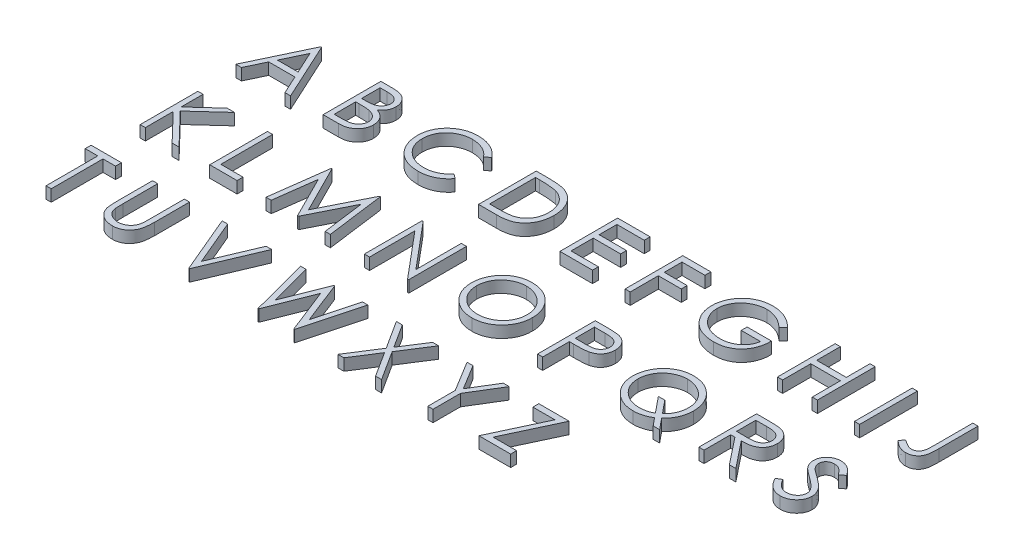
from build123d import *

# Parameters (mm, degrees)
BOSS_EXTRUDE1_DEPTH    = 3
BOSS_EXTRUDE1_2_DEPTH  = 3
BOSS_EXTRUDE1_3_DEPTH  = 3
BOSS_EXTRUDE1_4_DEPTH  = 3
BOSS_EXTRUDE1_5_DEPTH  = 3
BOSS_EXTRUDE1_6_DEPTH  = 3
BOSS_EXTRUDE1_7_DEPTH  = 3
BOSS_EXTRUDE1_8_DEPTH  = 3
SKETCH1_W              = 1.329700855
SKETCH1_H              = 14.816666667
BOSS_EXTRUDE1_9_DEPTH  = 3
BOSS_EXTRUDE1_10_DEPTH = 3
BOSS_EXTRUDE1_11_DEPTH = 3
BOSS_EXTRUDE1_12_DEPTH = 3
BOSS_EXTRUDE1_13_DEPTH = 3
BOSS_EXTRUDE1_14_DEPTH = 3
BOSS_EXTRUDE1_15_DEPTH = 3
BOSS_EXTRUDE1_16_DEPTH = 3
BOSS_EXTRUDE1_17_DEPTH = 3
BOSS_EXTRUDE1_18_DEPTH = 3
BOSS_EXTRUDE1_19_DEPTH = 3
BOSS_EXTRUDE1_20_DEPTH = 3
BOSS_EXTRUDE1_21_DEPTH = 3
BOSS_EXTRUDE1_22_DEPTH = 3
BOSS_EXTRUDE1_23_DEPTH = 3
BOSS_EXTRUDE1_24_DEPTH = 3
BOSS_EXTRUDE1_25_DEPTH = 3
BOSS_EXTRUDE1_26_DEPTH = 3


with BuildPart() as part:
    # Sketch1 → Boss-Extrude1 (new body)
    with BuildSketch(Plane(origin=(0, 0, 0), x_dir=(1, 0, 0), z_dir=(0, 1, 0))):
        Polygon((-57.22724981, 33.268423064), (-50.388788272, 18.451756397), (-51.834244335, 18.451756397), (-54.024689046, 23.200688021), (-60.741459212, 23.200688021), (-62.994233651, 18.451756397), (-64.445625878, 18.451756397), (-57.417207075, 33.268423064), align=None)
        Polygon((-57.337068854, 30.38047902), (-60.020215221, 24.720346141), (-54.725156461, 24.720346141), align=None, mode=Mode.SUBTRACT)
    extrude(amount=BOSS_EXTRUDE1_DEPTH)


with BuildPart() as body_2:
    # Sketch1 → Boss-Extrude1 2 (new body)
    with BuildSketch(Plane(origin=(0, 0, 0), x_dir=(1, 0, 0), z_dir=(0, 1, 0))):
        with BuildLine():
            Line((-42.030668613, 33.268423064), (-39.139756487, 33.268423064))
            add(Edge.make_bspline(
                [(-39.139756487, 33.268423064), (-38.998242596, 33.267679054), (-38.723953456, 33.266236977), (-38.325091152, 33.243871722), (-37.951504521, 33.213376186), (-37.603085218, 33.164988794), (-37.279994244, 33.106603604), (-36.981257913, 33.03589925), (-36.707826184, 32.951119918), (-36.381382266, 32.816303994), (-36.009184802, 32.615969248), (-35.606178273, 32.319938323), (-35.261566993, 31.957850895), (-34.964444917, 31.549407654), (-34.728220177, 31.100099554), (-34.557323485, 30.620635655), (-34.449128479, 30.11720028), (-34.438001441, 29.771577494), (-34.432378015, 29.596905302)],
                knots=[0, 0, 0, 0, 1.001505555, 1.941167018, 2.826882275, 3.653841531, 4.429895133, 5.150066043, 5.825578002, 6.45369114, 7.647487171, 8.808567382, 9.977351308, 11.170798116, 12.373658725, 13.556498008, 14.765093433, 16, 16, 16, 16], degree=3))
            add(Edge.make_bspline(
                [(-34.432378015, 29.596905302), (-34.437005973, 29.43327615), (-34.446100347, 29.111729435), (-34.533064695, 28.641431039), (-34.669211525, 28.193750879), (-34.858463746, 27.770322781), (-35.104428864, 27.380713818), (-35.395929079, 27.021781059), (-35.747620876, 26.708721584), (-36.011117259, 26.533703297), (-36.144961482, 26.444801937)],
                knots=[0, 0, 0, 0, 1.044552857, 2.05264487, 3.044412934, 4.028983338, 5.005914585, 5.980388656, 6.974128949, 8, 8, 8, 8], degree=3))
            add(Edge.make_bspline(
                [(-36.144961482, 26.444801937), (-35.976642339, 26.380180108), (-35.654606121, 26.256542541), (-35.211435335, 26.037952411), (-34.829610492, 25.800199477), (-34.506195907, 25.540561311), (-34.229599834, 25.260700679), (-33.988075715, 24.956514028), (-33.781991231, 24.624033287), (-33.605406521, 24.266724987), (-33.467616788, 23.888237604), (-33.364425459, 23.492121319), (-33.305296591, 23.079796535), (-33.296882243, 22.799188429), (-33.292634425, 22.657528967)],
                knots=[0, 0, 0, 0, 1.27268992, 2.434971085, 3.483601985, 4.442670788, 5.356604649, 6.2567628, 7.179492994, 8.113709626, 9.066344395, 10.018646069, 10.999752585, 12, 12, 12, 12], degree=3))
            add(Edge.make_bspline(
                [(-33.292634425, 22.657528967), (-33.29676974, 22.512889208), (-33.304906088, 22.228306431), (-33.364934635, 21.810243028), (-33.466573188, 21.410722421), (-33.606574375, 21.027160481), (-33.78929484, 20.660299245), (-34.011663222, 20.309723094), (-34.276803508, 19.978954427), (-34.573402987, 19.664317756), (-34.908946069, 19.381413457), (-35.270962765, 19.129463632), (-35.664012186, 18.922258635), (-36.081638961, 18.748200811), (-36.528527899, 18.615243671), (-37.00267227, 18.522226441), (-37.503663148, 18.459551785), (-37.847451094, 18.454398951), (-38.023757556, 18.451756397)],
                knots=[0, 0, 0, 0, 0.978564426, 1.925352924, 2.850884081, 3.763762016, 4.682927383, 5.618979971, 6.567305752, 7.547517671, 8.540179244, 9.531824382, 10.526200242, 11.540722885, 12.589160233, 13.674978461, 14.80764778, 16, 16, 16, 16], degree=3))
            Line((-38.023757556, 18.451756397), (-42.030668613, 18.451756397))
            Line((-42.030668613, 18.451756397), (-42.030668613, 33.268423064))
        make_face()
        with BuildLine():
            Line((-40.700967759, 31.748764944), (-40.700967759, 26.99983332))
            Line((-40.700967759, 26.99983332), (-39.807574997, 26.99983332))
            add(Edge.make_bspline(
                [(-39.807574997, 26.99983332), (-39.676981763, 27.001526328), (-39.424649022, 27.004797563), (-39.059228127, 27.014168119), (-38.720032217, 27.040406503), (-38.40764679, 27.066637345), (-38.122563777, 27.109286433), (-37.865414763, 27.160053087), (-37.632164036, 27.213744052), (-37.36317996, 27.305054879), (-37.058071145, 27.440003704), (-36.732811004, 27.649434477), (-36.446068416, 27.898880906), (-36.203933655, 28.186709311), (-36.005765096, 28.503642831), (-35.868123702, 28.844624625), (-35.774790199, 29.201156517), (-35.766359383, 29.445920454), (-35.76207887, 29.570192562)],
                knots=[0, 0, 0, 0, 1.156816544, 2.235205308, 3.236616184, 4.169592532, 5.011045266, 5.787822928, 6.49130361, 7.128639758, 8.301311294, 9.436451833, 10.541879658, 11.654887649, 12.756523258, 13.837046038, 14.901820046, 16, 16, 16, 16], degree=3))
            add(Edge.make_bspline(
                [(-35.76207887, 29.570192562), (-35.764306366, 29.652428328), (-35.768675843, 29.813742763), (-35.804461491, 30.048901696), (-35.865284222, 30.270066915), (-35.943407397, 30.480269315), (-36.052579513, 30.672936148), (-36.181118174, 30.85472901), (-36.336420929, 31.019456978), (-36.513193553, 31.173421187), (-36.716430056, 31.309923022), (-36.946009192, 31.429475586), (-37.205037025, 31.525744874), (-37.489148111, 31.610056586), (-37.802715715, 31.669273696), (-38.142121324, 31.718606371), (-38.510144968, 31.743721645), (-38.764759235, 31.747046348), (-38.896373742, 31.748764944)],
                knots=[0, 0, 0, 0, 0.91205012, 1.789085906, 2.630437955, 3.453916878, 4.269457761, 5.079663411, 5.91843418, 6.774407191, 7.675494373, 8.627863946, 9.638891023, 10.736472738, 11.911756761, 13.175263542, 14.539845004, 16, 16, 16, 16], degree=3))
            Line((-38.896373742, 31.748764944), (-40.700967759, 31.748764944))
        make_face(mode=Mode.SUBTRACT)
        with BuildLine():
            Line((-40.700967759, 25.480175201), (-40.700967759, 19.971414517))
            Line((-40.700967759, 19.971414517), (-38.807331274, 19.971414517))
            add(Edge.make_bspline(
                [(-38.807331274, 19.971414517), (-38.671784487, 19.973039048), (-38.410535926, 19.976170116), (-38.033340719, 19.986391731), (-37.683738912, 20.009642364), (-37.363325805, 20.046243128), (-37.068641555, 20.08594523), (-36.803221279, 20.139332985), (-36.564913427, 20.200500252), (-36.288585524, 20.295048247), (-35.977420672, 20.441929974), (-35.642094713, 20.663393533), (-35.343957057, 20.927228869), (-35.090781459, 21.232583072), (-34.883293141, 21.564609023), (-34.732351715, 21.916591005), (-34.639257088, 22.282713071), (-34.627987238, 22.53233882), (-34.62233528, 22.657528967)],
                knots=[0, 0, 0, 0, 1.160039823, 2.235823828, 3.228722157, 4.157150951, 4.99529583, 5.772374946, 6.472645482, 7.099169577, 8.269452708, 9.405989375, 10.527446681, 11.663510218, 12.788923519, 13.866172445, 14.929861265, 16, 16, 16, 16], degree=3))
            add(Edge.make_bspline(
                [(-34.62233528, 22.657528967), (-34.623504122, 22.735817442), (-34.625822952, 22.891131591), (-34.660792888, 23.119375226), (-34.711651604, 23.340464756), (-34.77740134, 23.555000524), (-34.873157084, 23.759103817), (-34.984944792, 23.956811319), (-35.116014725, 24.148384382), (-35.320248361, 24.390582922), (-35.617309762, 24.66963161), (-36.039401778, 24.94284037), (-36.519344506, 25.163176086), (-36.867440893, 25.256730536), (-37.047258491, 25.305058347)],
                knots=[0, 0, 0, 0, 0.723448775, 1.435228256, 2.130040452, 2.821711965, 3.505591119, 4.210454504, 4.921174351, 5.648778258, 7.137944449, 8.670945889, 10.280296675, 12, 12, 12, 12], degree=3))
            add(Edge.make_bspline(
                [(-37.047258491, 25.305058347), (-37.11934833, 25.319684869), (-37.275653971, 25.351398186), (-37.530532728, 25.38487413), (-37.821514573, 25.414698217), (-38.14927142, 25.436758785), (-38.514217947, 25.459561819), (-38.91713357, 25.468429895), (-39.356372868, 25.479010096), (-39.661140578, 25.479776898), (-39.819447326, 25.480175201)],
                knots=[0, 0, 0, 0, 0.634451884, 1.375622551, 2.216452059, 3.157844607, 4.20941857, 5.370758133, 6.634282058, 8, 8, 8, 8], degree=3))
            Line((-39.819447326, 25.480175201), (-40.700967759, 25.480175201))
        make_face(mode=Mode.SUBTRACT)
    extrude(amount=BOSS_EXTRUDE1_2_DEPTH)


with BuildPart() as body_3:
    # Sketch1 → Boss-Extrude1 3 (new body)
    with BuildSketch(Plane(origin=(0, 0, 0), x_dir=(1, 0, 0), z_dir=(0, 1, 0))):
        with BuildLine():
            Line((-10.87767716, 30.549659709), (-12.041165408, 29.65923503))
            add(Edge.make_bspline(
                [(-12.041165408, 29.65923503), (-12.124163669, 29.758150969), (-12.289041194, 29.954649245), (-12.554298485, 30.230575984), (-12.830742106, 30.48908559), (-13.118266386, 30.731409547), (-13.422046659, 30.949073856), (-13.73472404, 31.153421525), (-14.061529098, 31.336588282), (-14.513444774, 31.55868159), (-15.104620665, 31.790440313), (-15.848818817, 31.984763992), (-16.625682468, 32.108466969), (-17.155685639, 32.121864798), (-17.425266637, 32.128679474)],
                knots=[0, 0, 0, 0, 0.757959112, 1.505699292, 2.245454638, 2.979532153, 3.711538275, 4.438200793, 5.171680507, 5.909471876, 7.393775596, 8.890124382, 10.418191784, 12, 12, 12, 12], degree=3))
            add(Edge.make_bspline(
                [(-17.425266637, 32.128679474), (-17.573785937, 32.126969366), (-17.869446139, 32.123565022), (-18.308224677, 32.078653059), (-18.738809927, 32.015528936), (-19.160921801, 31.921865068), (-19.574022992, 31.803447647), (-19.980814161, 31.661946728), (-20.3754057, 31.486877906), (-20.763256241, 31.293379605), (-21.134854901, 31.074823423), (-21.486454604, 30.836430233), (-21.816773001, 30.580867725), (-22.126071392, 30.307178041), (-22.414665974, 30.016593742), (-22.68046559, 29.706018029), (-22.922550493, 29.376443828), (-23.145719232, 29.032217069), (-23.34558647, 28.674340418), (-23.512929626, 28.301489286), (-23.661117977, 27.920048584), (-23.778378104, 27.525708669), (-23.871191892, 27.121244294), (-23.935232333, 26.705569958), (-23.979633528, 26.279554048), (-23.983020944, 25.990801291), (-23.984728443, 25.845249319)],
                knots=[0, 0, 0, 0, 1.054917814, 2.100044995, 3.131103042, 4.146048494, 5.169673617, 6.183595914, 7.203665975, 8.234915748, 9.262203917, 10.264457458, 11.251630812, 12.227803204, 13.197192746, 14.159520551, 15.12972552, 16.100847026, 17.073214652, 18.039054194, 19.002613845, 19.979014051, 20.95965708, 21.949030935, 22.966165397, 24, 24, 24, 24], degree=3))
            add(Edge.make_bspline(
                [(-23.984728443, 25.845249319), (-23.979386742, 25.626253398), (-23.968899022, 25.196283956), (-23.875561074, 24.566488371), (-23.733722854, 23.963150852), (-23.521143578, 23.390042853), (-23.259019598, 22.840097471), (-22.927801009, 22.322619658), (-22.544191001, 21.829789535), (-22.102762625, 21.373254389), (-21.618444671, 20.956212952), (-21.098811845, 20.588968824), (-20.54515836, 20.282835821), (-19.963597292, 20.028090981), (-19.34965341, 19.832270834), (-18.704430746, 19.694416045), (-18.029332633, 19.604490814), (-17.56802884, 19.595881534), (-17.333256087, 19.591499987)],
                knots=[0, 0, 0, 0, 1.029171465, 2.020641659, 2.987623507, 3.938342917, 4.889210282, 5.84687017, 6.821220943, 7.821438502, 8.827599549, 9.822697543, 10.807740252, 11.797342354, 12.80366471, 13.83203677, 14.896651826, 16, 16, 16, 16], degree=3))
            add(Edge.make_bspline(
                [(-17.333256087, 19.591499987), (-17.074588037, 19.598649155), (-16.565467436, 19.612720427), (-15.818842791, 19.731927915), (-15.104104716, 19.9252131), (-14.421214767, 20.195714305), (-13.772098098, 20.547357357), (-13.155738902, 20.973645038), (-12.57161692, 21.478632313), (-12.220371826, 21.864217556), (-12.041165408, 22.060944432)],
                knots=[0, 0, 0, 0, 1.028121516, 2.023589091, 2.998037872, 3.967518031, 4.937445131, 5.927275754, 6.942489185, 8, 8, 8, 8], degree=3))
            Line((-12.041165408, 22.060944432), (-10.87767716, 21.179423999))
            add(Edge.make_bspline(
                [(-10.87767716, 21.179423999), (-10.971310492, 21.058611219), (-11.158128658, 20.817564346), (-11.460634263, 20.477747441), (-11.779308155, 20.158113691), (-12.116517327, 19.861240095), (-12.468382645, 19.58118619), (-12.841222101, 19.325908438), (-13.230134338, 19.091843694), (-13.633801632, 18.877523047), (-14.051795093, 18.687373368), (-14.483613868, 18.524585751), (-14.927396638, 18.384357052), (-15.38316369, 18.26899052), (-15.851860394, 18.178942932), (-16.331795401, 18.118746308), (-16.824004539, 18.077505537), (-17.156073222, 18.073746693), (-17.32435184, 18.071841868)],
                knots=[0, 0, 0, 0, 0.986787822, 1.968848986, 2.935600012, 3.899624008, 4.868462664, 5.837806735, 6.815139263, 7.798259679, 8.787526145, 9.778297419, 10.776456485, 11.791383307, 12.812564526, 13.85620153, 14.913611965, 16, 16, 16, 16], degree=3))
            add(Edge.make_bspline(
                [(-17.32435184, 18.071841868), (-17.48371003, 18.072950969), (-17.798821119, 18.075144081), (-18.264059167, 18.110670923), (-18.716981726, 18.159141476), (-19.156294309, 18.232124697), (-19.58439427, 18.31824907), (-19.997400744, 18.43369739), (-20.399377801, 18.563022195), (-20.788710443, 18.715019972), (-21.165729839, 18.886538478), (-21.529219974, 19.080389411), (-21.879013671, 19.294942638), (-22.218549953, 19.525468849), (-22.542813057, 19.77937276), (-22.854612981, 20.05312818), (-23.15569813, 20.345812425), (-23.341976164, 20.556864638), (-23.435633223, 20.662977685)],
                knots=[0, 0, 0, 0, 1.114604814, 2.203992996, 3.262667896, 4.300477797, 5.318619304, 6.316056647, 7.298880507, 8.271930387, 9.238335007, 10.195173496, 11.151986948, 12.108099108, 13.064862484, 14.031167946, 15.010108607, 16, 16, 16, 16], degree=3))
            add(Edge.make_bspline(
                [(-23.435633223, 20.662977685), (-23.585644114, 20.847302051), (-23.883854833, 21.213725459), (-24.265386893, 21.807602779), (-24.59197821, 22.42765153), (-24.856036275, 23.077129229), (-25.062465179, 23.754578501), (-25.205472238, 24.460340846), (-25.298400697, 25.193757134), (-25.309027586, 25.69259954), (-25.314429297, 25.946164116)],
                knots=[0, 0, 0, 0, 0.994628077, 1.977248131, 2.950237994, 3.925870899, 4.908910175, 5.911660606, 6.938484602, 8, 8, 8, 8], degree=3))
            add(Edge.make_bspline(
                [(-25.314429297, 25.946164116), (-25.307845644, 26.212675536), (-25.294892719, 26.737020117), (-25.184843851, 27.506529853), (-25.007810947, 28.243770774), (-24.756364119, 28.947366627), (-24.437571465, 29.621018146), (-24.0437588, 30.259579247), (-23.579501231, 30.867133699), (-23.048439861, 31.434462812), (-22.466071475, 31.953212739), (-21.84242183, 32.409592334), (-21.178711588, 32.789396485), (-20.482252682, 33.10688024), (-19.747829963, 33.350908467), (-18.977010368, 33.521736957), (-18.171242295, 33.628066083), (-17.62149136, 33.641507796), (-17.342160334, 33.648337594)],
                knots=[0, 0, 0, 0, 1.032925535, 2.032216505, 3.007276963, 3.968222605, 4.92396291, 5.891752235, 6.871517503, 7.883894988, 8.900124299, 9.891468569, 10.874487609, 11.85992873, 12.854644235, 13.869047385, 14.917252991, 16, 16, 16, 16], degree=3))
            add(Edge.make_bspline(
                [(-17.342160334, 33.648337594), (-17.171919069, 33.646296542), (-16.83494363, 33.642256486), (-16.336457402, 33.602860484), (-15.851138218, 33.537186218), (-15.378651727, 33.447794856), (-14.916699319, 33.336850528), (-14.468811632, 33.192323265), (-14.032360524, 33.027068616), (-13.610098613, 32.836744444), (-13.204051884, 32.623101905), (-12.814346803, 32.388509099), (-12.444078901, 32.133256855), (-12.090642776, 31.85951608), (-11.759950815, 31.561495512), (-11.44261389, 31.247392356), (-11.149408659, 30.908159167), (-10.968420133, 30.66937828), (-10.87767716, 30.549659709)],
                knots=[0, 0, 0, 0, 1.096760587, 2.17092713, 3.219439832, 4.250915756, 5.268269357, 6.278326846, 7.281116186, 8.274029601, 9.260640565, 10.235837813, 11.203064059, 12.156899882, 13.114053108, 14.069676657, 15.032185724, 16, 16, 16, 16], degree=3))
        make_face()
    extrude(amount=BOSS_EXTRUDE1_3_DEPTH)


with BuildPart() as body_4:
    # Sketch1 → Boss-Extrude1 4 (new body)
    with BuildSketch(Plane(origin=(0, 0, 0), x_dir=(1, 0, 0), z_dir=(0, 1, 0))):
        with BuildLine():
            Line((-2.139642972, 18.451756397), (-2.139642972, 33.268423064))
            Line((-2.139642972, 33.268423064), (0.852183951, 33.268423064))
            add(Edge.make_bspline(
                [(0.852183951, 33.268423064), (1.112402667, 33.266549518), (1.615143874, 33.262929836), (2.341636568, 33.23997928), (3.013821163, 33.199379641), (3.629486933, 33.140241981), (4.190324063, 33.067627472), (4.694762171, 32.976609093), (5.145409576, 32.869132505), (5.422563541, 32.777500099), (5.553626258, 32.734168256)],
                knots=[0, 0, 0, 0, 1.314313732, 2.53924729, 3.670748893, 4.714932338, 5.66265055, 6.526160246, 7.303039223, 8, 8, 8, 8], degree=3))
            add(Edge.make_bspline(
                [(5.553626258, 32.734168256), (5.725053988, 32.668844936), (6.064022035, 32.539679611), (6.546652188, 32.296024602), (7.000996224, 32.019955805), (7.429490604, 31.711109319), (7.822347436, 31.360740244), (8.194914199, 30.983731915), (8.531949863, 30.566374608), (8.840594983, 30.117323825), (9.118875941, 29.641869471), (9.360765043, 29.140917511), (9.561653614, 28.617011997), (9.728418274, 28.07160987), (9.859848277, 27.503511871), (9.949518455, 26.912056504), (10.008662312, 26.299581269), (10.014606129, 25.88397604), (10.017621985, 25.673100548)],
                knots=[0, 0, 0, 0, 0.984719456, 1.947108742, 2.898477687, 3.838006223, 4.779231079, 5.722358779, 6.681677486, 7.655904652, 8.64651281, 9.637519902, 10.640069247, 11.656948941, 12.698408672, 13.768548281, 14.867775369, 16, 16, 16, 16], degree=3))
            add(Edge.make_bspline(
                [(10.017621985, 25.673100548), (10.014959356, 25.489961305), (10.009712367, 25.129066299), (9.962598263, 24.597186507), (9.894118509, 24.081085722), (9.788098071, 23.583221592), (9.659394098, 23.099232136), (9.494445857, 22.634275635), (9.305488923, 22.184086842), (9.085144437, 21.754752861), (8.843245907, 21.347999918), (8.583650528, 20.964563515), (8.306635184, 20.609915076), (8.009558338, 20.282980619), (7.696259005, 19.984253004), (7.364686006, 19.711236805), (7.013983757, 19.469274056), (6.645723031, 19.248856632), (6.249160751, 19.056577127), (5.816785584, 18.893890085), (5.346753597, 18.759072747), (4.840218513, 18.646589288), (4.296305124, 18.55736204), (3.714480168, 18.497560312), (3.095637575, 18.457119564), (2.670698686, 18.453578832), (2.451980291, 18.451756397)],
                knots=[0, 0, 0, 0, 1.105936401, 2.179363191, 3.223086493, 4.248585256, 5.251745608, 6.245858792, 7.225916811, 8.198733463, 9.158002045, 10.082870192, 10.993790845, 11.873723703, 12.748670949, 13.606408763, 14.465103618, 15.319838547, 16.196477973, 17.123216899, 18.106603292, 19.147568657, 20.255746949, 21.433717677, 22.679120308, 24, 24, 24, 24], degree=3))
            Line((2.451980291, 18.451756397), (-2.139642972, 18.451756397))
        make_face()
        with BuildLine():
            Line((-0.809942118, 19.971414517), (0.89076902, 19.971414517))
            add(Edge.make_bspline(
                [(0.89076902, 19.971414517), (1.135152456, 19.972464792), (1.605191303, 19.974484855), (2.281076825, 19.992210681), (2.898632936, 20.021174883), (3.457947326, 20.061709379), (3.958704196, 20.11533985), (4.40195007, 20.175135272), (4.786231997, 20.249631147), (5.018766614, 20.317156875), (5.126222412, 20.348360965)],
                knots=[0, 0, 0, 0, 1.375205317, 2.645023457, 3.804390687, 4.853969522, 5.800190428, 6.637939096, 7.370582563, 8, 8, 8, 8], degree=3))
            add(Edge.make_bspline(
                [(5.126222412, 20.348360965), (5.261470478, 20.395992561), (5.528736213, 20.490118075), (5.913466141, 20.661812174), (6.272270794, 20.865190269), (6.611403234, 21.091259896), (6.926052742, 21.347994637), (7.219948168, 21.629811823), (7.492497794, 21.938145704), (7.740885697, 22.272613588), (7.963170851, 22.631133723), (8.155665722, 23.010181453), (8.324370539, 23.405603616), (8.456783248, 23.823472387), (8.560565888, 24.260052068), (8.6340764, 24.715373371), (8.679858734, 25.189351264), (8.685198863, 25.51172859), (8.68792113, 25.67606863)],
                knots=[0, 0, 0, 0, 0.998632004, 1.973411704, 2.929992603, 3.868527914, 4.809262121, 5.754881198, 6.702106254, 7.672490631, 8.653608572, 9.636854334, 10.631411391, 11.644891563, 12.686317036, 13.754757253, 14.855430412, 16, 16, 16, 16], degree=3))
            add(Edge.make_bspline(
                [(8.68792113, 25.67606863), (8.685748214, 25.849353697), (8.6814795, 26.189773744), (8.627824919, 26.689267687), (8.549417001, 27.169669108), (8.43603273, 27.631010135), (8.291545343, 28.074190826), (8.111228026, 28.496760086), (7.905206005, 28.903180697), (7.660081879, 29.284072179), (7.391622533, 29.644299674), (7.093689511, 29.974308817), (6.771016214, 30.274851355), (6.427122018, 30.550607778), (6.052314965, 30.790484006), (5.655424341, 31.005057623), (5.230627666, 31.18715823), (4.935087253, 31.284012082), (4.784892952, 31.333233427)],
                knots=[0, 0, 0, 0, 1.122418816, 2.205001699, 3.251619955, 4.274784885, 5.280384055, 6.268708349, 7.249350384, 8.229342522, 9.199999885, 10.157847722, 11.105861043, 12.055065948, 13.010012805, 13.98527497, 14.976112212, 16, 16, 16, 16], degree=3))
            add(Edge.make_bspline(
                [(4.784892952, 31.333233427), (4.660639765, 31.367592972), (4.3964434, 31.440650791), (3.965323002, 31.520344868), (3.48011887, 31.590637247), (2.938676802, 31.650149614), (2.341613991, 31.692852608), (1.688471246, 31.724904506), (0.978966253, 31.746522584), (0.48712686, 31.747998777), (0.231854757, 31.748764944)],
                knots=[0, 0, 0, 0, 0.674548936, 1.434276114, 2.292660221, 3.240891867, 4.284742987, 5.42552168, 6.663806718, 8, 8, 8, 8], degree=3))
            Line((0.231854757, 31.748764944), (-0.809942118, 31.748764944))
            Line((-0.809942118, 31.748764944), (-0.809942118, 19.971414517))
        make_face(mode=Mode.SUBTRACT)
    extrude(amount=BOSS_EXTRUDE1_4_DEPTH)


with BuildPart() as body_5:
    # Sketch1 → Boss-Extrude1 5 (new body)
    with BuildSketch(Plane(origin=(0, 0, 0), x_dir=(1, 0, 0), z_dir=(0, 1, 0))):
        Polygon((18.755656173, 33.268423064), (27.113775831, 33.268423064), (27.113775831, 31.748764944), (20.085357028, 31.748764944), (20.085357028, 27.189790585), (27.113775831, 27.189790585), (27.113775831, 25.670132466), (20.085357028, 25.670132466), (20.085357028, 19.971414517), (27.113775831, 19.971414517), (27.113775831, 18.451756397), (18.755656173, 18.451756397), align=None)
    extrude(amount=BOSS_EXTRUDE1_5_DEPTH)


with BuildPart() as body_6:
    # Sketch1 → Boss-Extrude1 6 (new body)
    with BuildSketch(Plane(origin=(0, 0, 0), x_dir=(1, 0, 0), z_dir=(0, 1, 0))):
        Polygon((35.471895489, 33.268423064), (42.690271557, 33.268423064), (42.690271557, 31.748764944), (36.801596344, 31.748764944), (36.801596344, 27.189790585), (42.690271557, 27.189790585), (42.690271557, 25.670132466), (36.801596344, 25.670132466), (36.801596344, 18.451756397), (35.471895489, 18.451756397), align=None)
    extrude(amount=BOSS_EXTRUDE1_6_DEPTH)


with BuildPart() as body_7:
    # Sketch1 → Boss-Extrude1 7 (new body)
    with BuildSketch(Plane(origin=(0, 0, 0), x_dir=(1, 0, 0), z_dir=(0, 1, 0))):
        with BuildLine():
            Line((64.915271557, 30.739616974), (63.775527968, 29.65923503))
            add(Edge.make_bspline(
                [(63.775527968, 29.65923503), (63.569284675, 29.85325235), (63.161716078, 30.236660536), (62.497251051, 30.734123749), (61.803985, 31.160276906), (61.08553543, 31.507013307), (60.359694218, 31.783673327), (59.636095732, 31.980642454), (58.922162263, 32.106256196), (58.447321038, 32.121277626), (58.213341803, 32.128679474)],
                knots=[0, 0, 0, 0, 1.08915593, 2.152340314, 3.188132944, 4.216796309, 5.218260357, 6.173443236, 7.099959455, 8, 8, 8, 8], degree=3))
            add(Edge.make_bspline(
                [(58.213341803, 32.128679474), (58.069769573, 32.126928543), (57.782997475, 32.123431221), (57.357031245, 32.078794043), (56.935532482, 32.014596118), (56.519296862, 31.921708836), (56.107515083, 31.803983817), (55.701619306, 31.656725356), (55.300852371, 31.485041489), (54.908989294, 31.286657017), (54.529087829, 31.068725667), (54.170283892, 30.827220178), (53.830290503, 30.569880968), (53.515498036, 30.290265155), (53.224095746, 29.990905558), (52.949147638, 29.677370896), (52.700323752, 29.341095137), (52.475571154, 28.98826532), (52.275073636, 28.625078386), (52.098083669, 28.255030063), (51.949505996, 27.879347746), (51.831948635, 27.497560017), (51.734960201, 27.11262052), (51.666728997, 26.72186387), (51.628261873, 26.324871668), (51.621608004, 26.059029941), (51.61826301, 25.925387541)],
                knots=[0, 0, 0, 0, 1.02818874, 2.053710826, 3.065248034, 4.081641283, 5.106893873, 6.131558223, 7.173050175, 8.228653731, 9.27666206, 10.308777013, 11.325269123, 12.329503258, 13.32196095, 14.316845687, 15.314881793, 16.315733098, 17.311955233, 18.285320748, 19.252783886, 20.203351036, 21.145449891, 22.095197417, 23.042428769, 24, 24, 24, 24], degree=3))
            add(Edge.make_bspline(
                [(51.61826301, 25.925387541), (51.621462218, 25.788774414), (51.627851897, 25.515921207), (51.668747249, 25.108699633), (51.744643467, 24.707526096), (51.846106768, 24.311082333), (51.973025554, 23.918689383), (52.131236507, 23.532048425), (52.31862755, 23.151173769), (52.535528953, 22.77949719), (52.773383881, 22.417449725), (53.039842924, 22.076414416), (53.322886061, 21.751849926), (53.632824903, 21.450962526), (53.959720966, 21.165704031), (54.313340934, 20.903933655), (54.68673135, 20.660609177), (55.08046188, 20.438797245), (55.490260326, 20.24064111), (55.910447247, 20.064433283), (56.342365, 19.919317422), (56.78374372, 19.801046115), (57.234057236, 19.704101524), (57.695591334, 19.641734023), (58.164952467, 19.596476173), (58.481346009, 19.593167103), (58.640745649, 19.591499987)],
                knots=[0, 0, 0, 0, 0.93586088, 1.869166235, 2.799637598, 3.729985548, 4.670839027, 5.622275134, 6.589130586, 7.576015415, 8.568469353, 9.55398029, 10.53834874, 11.515998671, 12.510579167, 13.508179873, 14.527009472, 15.561807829, 16.601455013, 17.643573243, 18.680854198, 19.719860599, 20.772568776, 21.833555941, 22.908541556, 24, 24, 24, 24], degree=3))
            add(Edge.make_bspline(
                [(58.640745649, 19.591499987), (58.832847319, 19.595515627), (59.210070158, 19.603400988), (59.764579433, 19.664785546), (60.297145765, 19.760656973), (60.806272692, 19.901059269), (61.292551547, 20.080144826), (61.757764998, 20.296025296), (62.198250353, 20.556980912), (62.615331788, 20.851510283), (62.999537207, 21.179656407), (63.346052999, 21.533751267), (63.649352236, 21.912076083), (63.913955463, 22.312402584), (64.132855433, 22.738044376), (64.312529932, 23.186915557), (64.4502542, 23.659218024), (64.50679026, 23.985572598), (64.535357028, 24.150474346)],
                knots=[0, 0, 0, 0, 1.13008108, 2.219097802, 3.278683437, 4.311054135, 5.322181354, 6.324827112, 7.324222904, 8.330512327, 9.32562643, 10.293043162, 11.24128371, 12.174520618, 13.111833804, 14.052305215, 15.015860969, 16, 16, 16, 16], degree=3))
            Line((64.535357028, 24.150474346), (59.596468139, 24.150474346))
            Line((59.596468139, 24.150474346), (59.596468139, 25.670132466))
            Line((59.596468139, 25.670132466), (65.865057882, 25.670132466))
            add(Edge.make_bspline(
                [(65.865057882, 25.670132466), (65.857836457, 25.386890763), (65.843702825, 24.832535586), (65.744562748, 24.024094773), (65.584472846, 23.260521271), (65.365777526, 22.541010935), (65.082672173, 21.866583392), (64.738195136, 21.236553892), (64.326833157, 20.65499261), (63.863238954, 20.117151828), (63.342962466, 19.637391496), (62.780061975, 19.215726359), (62.173607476, 18.860538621), (61.524172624, 18.571568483), (60.833883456, 18.346041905), (60.101142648, 18.18614223), (59.326943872, 18.090342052), (58.79635194, 18.078101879), (58.524990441, 18.071841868)],
                knots=[0, 0, 0, 0, 1.140356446, 2.231883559, 3.274166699, 4.278491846, 5.25512956, 6.21435461, 7.1637429, 8.11826594, 9.068280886, 10.0076534, 10.945064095, 11.891975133, 12.864533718, 13.863980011, 14.907571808, 16, 16, 16, 16], degree=3))
            add(Edge.make_bspline(
                [(58.524990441, 18.071841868), (58.357730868, 18.074251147), (58.027841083, 18.079003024), (57.540622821, 18.112773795), (57.066838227, 18.164761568), (56.606556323, 18.243269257), (56.158084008, 18.33942796), (55.723661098, 18.462561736), (55.301632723, 18.605092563), (54.891346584, 18.767210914), (54.496526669, 18.955050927), (54.115414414, 19.163795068), (53.745903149, 19.392366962), (53.390509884, 19.644719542), (53.047382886, 19.91896529), (52.718734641, 20.21565388), (52.402725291, 20.533878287), (52.204772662, 20.759849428), (52.105028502, 20.873711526)],
                knots=[0, 0, 0, 0, 1.107784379, 2.184907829, 3.233506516, 4.263428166, 5.276301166, 6.270063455, 7.25232949, 8.225834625, 9.190232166, 10.146266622, 11.1027726, 12.066435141, 13.031522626, 14.010570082, 14.99756817, 16, 16, 16, 16], degree=3))
            add(Edge.make_bspline(
                [(52.105028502, 20.873711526), (51.960308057, 21.054350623), (51.673269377, 21.412630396), (51.303791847, 21.986670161), (50.988825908, 22.581038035), (50.733268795, 23.197388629), (50.533717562, 23.83514543), (50.390604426, 24.493493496), (50.306753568, 25.173280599), (50.294673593, 25.633296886), (50.288562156, 25.866025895)],
                knots=[0, 0, 0, 0, 1.023165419, 2.029347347, 3.013907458, 3.994755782, 4.975994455, 5.96558838, 6.970761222, 8, 8, 8, 8], degree=3))
            add(Edge.make_bspline(
                [(50.288562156, 25.866025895), (50.290815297, 26.040296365), (50.295292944, 26.386622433), (50.349587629, 26.900791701), (50.427486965, 27.405831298), (50.541986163, 27.901328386), (50.686327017, 28.387613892), (50.866470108, 28.864913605), (51.076210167, 29.333509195), (51.319988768, 29.790175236), (51.591279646, 30.228851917), (51.885708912, 30.647773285), (52.207457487, 31.039310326), (52.551271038, 31.408421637), (52.92125163, 31.75047009), (53.31393319, 32.068622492), (53.729618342, 32.363305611), (54.169614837, 32.629877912), (54.627355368, 32.869330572), (55.101742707, 33.079258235), (55.592632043, 33.25275427), (56.096345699, 33.399963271), (56.616696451, 33.508824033), (57.149908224, 33.587770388), (57.698760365, 33.64179026), (58.069752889, 33.646134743), (58.257863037, 33.648337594)],
                knots=[0, 0, 0, 0, 1.008945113, 2.00506715, 2.99143336, 3.967273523, 4.948097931, 5.927297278, 6.919902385, 7.919676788, 8.923139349, 9.905703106, 10.883022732, 11.856032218, 12.825136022, 13.798837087, 14.781400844, 15.773989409, 16.776158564, 17.77167057, 18.775803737, 19.789618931, 20.80898985, 21.851988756, 22.910860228, 24, 24, 24, 24], degree=3))
            add(Edge.make_bspline(
                [(58.257863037, 33.648337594), (58.411271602, 33.645884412), (58.715462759, 33.641020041), (59.168115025, 33.607303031), (59.613770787, 33.553861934), (60.053090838, 33.480935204), (60.484579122, 33.381605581), (60.909464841, 33.262740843), (61.328363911, 33.124345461), (61.7399635, 32.959292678), (62.147031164, 32.771952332), (62.551830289, 32.561075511), (62.952977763, 32.323056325), (63.351169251, 32.057188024), (63.748915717, 31.768036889), (64.139926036, 31.447333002), (64.5336385, 31.107723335), (64.786799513, 30.863535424), (64.915271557, 30.739616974)],
                knots=[0, 0, 0, 0, 0.985871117, 1.954866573, 2.915460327, 3.869826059, 4.81536089, 5.759505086, 6.70452669, 7.649098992, 8.607881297, 9.583363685, 10.581137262, 11.603961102, 12.659522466, 13.73993555, 14.853081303, 16, 16, 16, 16], degree=3))
        make_face()
    extrude(amount=BOSS_EXTRUDE1_7_DEPTH)


with BuildPart() as body_8:
    # Sketch1 → Boss-Extrude1 8 (new body)
    with BuildSketch(Plane(origin=(0, 0, 0), x_dir=(1, 0, 0), z_dir=(0, 1, 0))):
        Polygon((74.60309207, 33.268423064), (75.932792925, 33.268423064), (75.932792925, 27.189790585), (83.531083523, 27.189790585), (83.531083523, 33.268423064), (84.860784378, 33.268423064), (84.860784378, 18.451756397), (83.531083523, 18.451756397), (83.531083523, 25.670132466), (75.932792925, 25.670132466), (75.932792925, 18.451756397), (74.60309207, 18.451756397), align=None)
    extrude(amount=BOSS_EXTRUDE1_8_DEPTH)


with BuildPart() as body_9:
    # Sketch1 → Boss-Extrude1 9 (new body)
    with BuildSketch(Plane(origin=(0, 0, 0), x_dir=(1, 0, 0), z_dir=(0, 1, 0))):
        with Locations((95.023498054, 25.860089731)):
            Rectangle(SKETCH1_W, SKETCH1_H)
    extrude(amount=BOSS_EXTRUDE1_9_DEPTH)


with BuildPart() as body_10:
    # Sketch1 → Boss-Extrude1 10 (new body)
    with BuildSketch(Plane(origin=(0, 0, 0), x_dir=(1, 0, 0), z_dir=(0, 1, 0))):
        with BuildLine():
            Line((109.935143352, 33.268423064), (111.264844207, 33.268423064))
            Line((111.264844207, 33.268423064), (111.264844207, 23.263017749))
            add(Edge.make_bspline(
                [(111.264844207, 23.263017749), (111.263515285, 23.077999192), (111.260963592, 22.722740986), (111.246932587, 22.211041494), (111.220967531, 21.743805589), (111.183142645, 21.31997083), (111.132680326, 20.940865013), (111.074933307, 20.603558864), (111.005029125, 20.310867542), (110.899761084, 19.982211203), (110.727151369, 19.621769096), (110.467364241, 19.232492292), (110.144645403, 18.891990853), (109.770837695, 18.596280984), (109.342674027, 18.360665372), (108.868971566, 18.191521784), (108.352646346, 18.088351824), (107.99450968, 18.077455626), (107.809996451, 18.071841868)],
                knots=[0, 0, 0, 0, 1.237770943, 2.376671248, 3.424123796, 4.367912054, 5.222547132, 5.982086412, 6.656319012, 7.234008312, 8.288027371, 9.317870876, 10.352700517, 11.413286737, 12.494591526, 13.606319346, 14.766767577, 16, 16, 16, 16], degree=3))
            add(Edge.make_bspline(
                [(107.809996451, 18.071841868), (107.666239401, 18.076416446), (107.376990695, 18.085620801), (106.946500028, 18.16064272), (106.517231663, 18.276280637), (106.086907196, 18.445624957), (105.647024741, 18.675941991), (105.191626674, 18.977291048), (104.714855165, 19.349111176), (104.400812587, 19.632904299), (104.236425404, 19.781457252)],
                knots=[0, 0, 0, 0, 0.848567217, 1.707373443, 2.573483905, 3.470863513, 4.432650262, 5.500696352, 6.691726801, 8, 8, 8, 8], degree=3))
            Line((104.236425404, 19.781457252), (105.019999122, 20.921200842))
            add(Edge.make_bspline(
                [(105.019999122, 20.921200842), (105.200773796, 20.796540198), (105.542099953, 20.561164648), (106.043768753, 20.258368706), (106.488256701, 19.998758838), (106.779014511, 19.866457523), (106.913635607, 19.80520191)],
                knots=[0, 0, 0, 0, 1.196737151, 2.259595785, 3.194191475, 4, 4, 4, 4], degree=3))
            add(Edge.make_bspline(
                [(106.913635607, 19.80520191), (106.995272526, 19.773200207), (107.155380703, 19.710437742), (107.40017354, 19.640393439), (107.643569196, 19.602113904), (107.8049341, 19.59499626), (107.884198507, 19.591499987)],
                knots=[0, 0, 0, 0, 1.051806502, 2.062826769, 3.048436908, 4, 4, 4, 4], degree=3))
            add(Edge.make_bspline(
                [(107.884198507, 19.591499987), (107.986572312, 19.595829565), (108.188927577, 19.604387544), (108.482991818, 19.679949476), (108.764330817, 19.795284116), (109.022859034, 19.964157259), (109.261133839, 20.164950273), (109.457741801, 20.407757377), (109.621644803, 20.676853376), (109.720280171, 20.931579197), (109.783123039, 21.163890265), (109.823007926, 21.37739054), (109.857884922, 21.626994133), (109.888286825, 21.912998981), (109.906085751, 22.235977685), (109.926055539, 22.59498189), (109.933274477, 22.990916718), (109.934501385, 23.266976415), (109.935143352, 23.411421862)],
                knots=[0, 0, 0, 0, 0.997221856, 1.971139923, 2.944579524, 3.951425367, 4.971190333, 5.972282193, 6.985401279, 8.033996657, 8.624075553, 9.332086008, 10.151144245, 11.082816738, 12.137127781, 13.306538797, 14.590673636, 16, 16, 16, 16], degree=3))
            Line((109.935143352, 23.411421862), (109.935143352, 33.268423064))
        make_face()
    extrude(amount=BOSS_EXTRUDE1_10_DEPTH)


with BuildPart() as body_11:
    # Sketch1 → Boss-Extrude1 11 (new body)
    with BuildSketch(Plane(origin=(0, 0, 0), x_dir=(1, 0, 0), z_dir=(0, 1, 0))):
        Polygon((-63.305882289, 7.57397862), (-61.976181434, 7.57397862), (-61.976181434, 1.931654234), (-55.799602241, 7.57397862), (-53.902997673, 7.57397862), (-61.183703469, 0.925474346), (-53.333125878, -7.242688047), (-55.105070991, -7.242688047), (-61.976181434, -0.092577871), (-61.976181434, -7.242688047), (-63.305882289, -7.242688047), align=None)
    extrude(amount=BOSS_EXTRUDE1_11_DEPTH)


with BuildPart() as body_12:
    # Sketch1 → Boss-Extrude1 12 (new body)
    with BuildSketch(Plane(origin=(0, 0, 0), x_dir=(1, 0, 0), z_dir=(0, 1, 0))):
        Polygon((-45.449899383, 7.57397862), (-44.120198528, 7.57397862), (-44.120198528, -5.723029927), (-38.421480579, -5.723029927), (-38.421480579, -7.242688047), (-45.449899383, -7.242688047), align=None)
    extrude(amount=BOSS_EXTRUDE1_12_DEPTH)


with BuildPart() as body_13:
    # Sketch1 → Boss-Extrude1 13 (new body)
    with BuildSketch(Plane(origin=(0, 0, 0), x_dir=(1, 0, 0), z_dir=(0, 1, 0))):
        Polygon((-31.013147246, -7.242688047), (-29.057181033, 7.57397862), (-28.867223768, 7.57397862), (-22.75000622, -4.583286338), (-16.647629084, 7.57397862), (-16.454703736, 7.57397862), (-14.486865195, -7.242688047), (-15.822502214, -7.242688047), (-17.241245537, 3.418663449), (-22.589729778, -7.242688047), (-22.889506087, -7.242688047), (-28.258766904, 3.442408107), (-29.674542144, -7.242688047), align=None)
    extrude(amount=BOSS_EXTRUDE1_13_DEPTH)


with BuildPart() as body_14:
    # Sketch1 → Boss-Extrude1 14 (new body)
    with BuildSketch(Plane(origin=(0, 0, 0), x_dir=(1, 0, 0), z_dir=(0, 1, 0))):
        Polygon((-5.748831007, -7.242688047), (-5.748831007, 7.57397862), (-5.469831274, 7.57397862), (4.318904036, -4.087616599), (4.318904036, 7.57397862), (5.648604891, 7.57397862), (5.648604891, -7.242688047), (5.3458605, -7.242688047), (-4.419130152, 4.392194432), (-4.419130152, -7.242688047), align=None)
    extrude(amount=BOSS_EXTRUDE1_14_DEPTH)


with BuildPart() as body_15:
    # Sketch1 → Boss-Extrude1 15 (new body)
    with BuildSketch(Plane(origin=(0, 0, 0), x_dir=(1, 0, 0), z_dir=(0, 1, 0))):
        with BuildLine():
            add(Edge.make_bspline(
                [(22.07990831, 7.95389315), (22.354262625, 7.94694422), (22.893117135, 7.93329595), (23.685067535, 7.828821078), (24.441120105, 7.64807726), (25.167433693, 7.407357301), (25.855320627, 7.086240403), (26.509958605, 6.698106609), (27.129790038, 6.2388896), (27.706460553, 5.712139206), (28.234174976, 5.139015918), (28.699104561, 4.527392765), (29.088750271, 3.880967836), (29.408730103, 3.201683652), (29.659760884, 2.491076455), (29.832984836, 1.745357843), (29.943636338, 0.969359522), (29.956572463, 0.440079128), (29.963134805, 0.171581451)],
                knots=[0, 0, 0, 0, 1.065120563, 2.091984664, 3.0946048, 4.079830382, 5.057816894, 6.036188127, 7.030412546, 8.04752943, 9.064399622, 10.05169764, 11.02544977, 11.989514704, 12.962713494, 13.945757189, 14.957906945, 16, 16, 16, 16], degree=3))
            add(Edge.make_bspline(
                [(29.963134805, 0.171581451), (29.956573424, -0.094938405), (29.943640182, -0.620279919), (29.832859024, -1.391353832), (29.659118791, -2.132571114), (29.411061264, -2.842694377), (29.092606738, -3.522472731), (28.700366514, -4.170117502), (28.238335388, -4.785841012), (27.712526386, -5.362897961), (27.139328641, -5.892053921), (26.524520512, -6.353143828), (25.881928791, -6.749909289), (25.20328436, -7.066493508), (24.497587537, -7.319527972), (23.758522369, -7.492047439), (22.989551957, -7.603329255), (22.465164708, -7.616107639), (22.1986316, -7.622602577)],
                knots=[0, 0, 0, 0, 1.043624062, 2.057103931, 3.04512605, 4.022047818, 4.998200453, 5.980619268, 6.982898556, 8.009068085, 9.034988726, 10.034168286, 11.015286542, 11.987931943, 12.962482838, 13.94673481, 14.956375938, 16, 16, 16, 16], degree=3))
            add(Edge.make_bspline(
                [(22.1986316, -7.622602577), (21.930135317, -7.616043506), (21.400857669, -7.603113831), (20.623884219, -7.492279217), (19.87764177, -7.318961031), (19.16426435, -7.071271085), (18.483354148, -6.751158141), (17.833579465, -6.36082627), (17.217548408, -5.897669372), (16.640368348, -5.372030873), (16.112263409, -4.799804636), (15.651848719, -4.186672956), (15.261429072, -3.544664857), (14.942390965, -2.871998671), (14.68981142, -2.17192623), (14.517494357, -1.439777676), (14.406005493, -0.679727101), (14.393157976, -0.162232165), (14.386639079, 0.100347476)],
                knots=[0, 0, 0, 0, 1.053102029, 2.075944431, 3.073151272, 4.055350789, 5.033113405, 6.020478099, 7.024410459, 8.052272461, 9.079885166, 10.07527673, 11.055994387, 12.023226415, 12.992069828, 13.970394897, 14.97016774, 16, 16, 16, 16], degree=3))
            add(Edge.make_bspline(
                [(14.386639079, 0.100347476), (14.388902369, 0.276592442), (14.393400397, 0.626858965), (14.447551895, 1.146994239), (14.526129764, 1.658764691), (14.638744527, 2.160715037), (14.786029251, 2.651616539), (14.959816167, 3.134854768), (15.172074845, 3.605532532), (15.412022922, 4.065879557), (15.679831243, 4.508719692), (15.975638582, 4.927309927), (16.289054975, 5.325162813), (16.632646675, 5.691968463), (16.995089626, 6.038397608), (17.382263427, 6.359126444), (17.791805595, 6.657047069), (18.225478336, 6.925526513), (18.672595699, 7.16834685), (19.133507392, 7.376719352), (19.601953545, 7.555561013), (20.080128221, 7.700513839), (20.566761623, 7.814949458), (21.062915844, 7.892873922), (21.568195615, 7.947163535), (21.908603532, 7.951640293), (22.07990831, 7.95389315)],
                knots=[0, 0, 0, 0, 1.037015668, 2.060948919, 3.074880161, 4.083647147, 5.086022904, 6.090072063, 7.104153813, 8.122640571, 9.144368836, 10.147691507, 11.138137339, 12.123020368, 13.103399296, 14.087645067, 15.080126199, 16.082011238, 17.087798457, 18.072939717, 19.057185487, 20.037253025, 21.01195951, 21.997135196, 22.992090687, 24, 24, 24, 24], degree=3))
        make_face()
        with BuildLine():
            add(Edge.make_bspline(
                [(22.145206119, 6.43423503), (22.004597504, 6.432520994), (21.724724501, 6.42910931), (21.308653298, 6.384169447), (20.898054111, 6.320119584), (20.492842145, 6.228757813), (20.094712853, 6.104280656), (19.699955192, 5.961020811), (19.312168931, 5.786518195), (18.932634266, 5.589360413), (18.564693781, 5.371136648), (18.217506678, 5.129956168), (17.890174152, 4.871474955), (17.583497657, 4.595089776), (17.298377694, 4.299393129), (17.029202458, 3.988867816), (16.786761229, 3.654638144), (16.564572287, 3.305767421), (16.365741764, 2.942710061), (16.188935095, 2.569288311), (16.044307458, 2.182456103), (15.926356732, 1.78641017), (15.828567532, 1.381777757), (15.766617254, 0.96548933), (15.721183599, 0.539636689), (15.71796692, 0.251846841), (15.716339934, 0.106283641)],
                knots=[0, 0, 0, 0, 1.008559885, 2.007477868, 2.99961109, 3.989939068, 4.984837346, 5.991145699, 7.001802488, 8.033829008, 9.059044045, 10.069351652, 11.065060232, 12.050310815, 13.029377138, 14.011219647, 14.996725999, 15.989392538, 16.977580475, 17.965360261, 18.951710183, 19.937753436, 20.929683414, 21.935841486, 22.955955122, 24, 24, 24, 24], degree=3))
            add(Edge.make_bspline(
                [(15.716339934, 0.106283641), (15.721736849, -0.107763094), (15.732354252, -0.528859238), (15.825307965, -1.145944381), (15.968487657, -1.738984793), (16.179550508, -2.304735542), (16.443501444, -2.848059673), (16.769581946, -3.364137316), (17.155912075, -3.853107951), (17.594754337, -4.311557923), (18.074487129, -4.730005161), (18.583895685, -5.097303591), (19.117522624, -5.408073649), (19.676759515, -5.661248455), (20.258620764, -5.861865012), (20.86685573, -5.999357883), (21.497412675, -6.089847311), (21.927225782, -6.098537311), (22.145206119, -6.102944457)],
                knots=[0, 0, 0, 0, 1.032063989, 2.030389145, 3.003944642, 3.970395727, 4.937377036, 5.913328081, 6.909231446, 7.93887556, 8.970685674, 9.976071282, 10.964166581, 11.944589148, 12.933237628, 13.927779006, 14.949070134, 16, 16, 16, 16], degree=3))
            add(Edge.make_bspline(
                [(22.145206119, -6.102944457), (22.291719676, -6.100931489), (22.582300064, -6.096939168), (23.014504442, -6.056728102), (23.438922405, -5.992246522), (23.854958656, -5.899406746), (24.262141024, -5.783213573), (24.662169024, -5.645174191), (25.050781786, -5.472957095), (25.432881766, -5.282677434), (25.798625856, -5.065760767), (26.147772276, -4.832765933), (26.471520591, -4.574665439), (26.77796766, -4.302386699), (27.06425821, -4.010439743), (27.328456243, -3.699204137), (27.569672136, -3.366715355), (27.791776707, -3.018373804), (27.989910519, -2.654323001), (28.162542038, -2.279547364), (28.308998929, -1.894969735), (28.427229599, -1.500035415), (28.519878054, -1.095494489), (28.583716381, -0.680805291), (28.628371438, -0.256797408), (28.631737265, 0.029984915), (28.633433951, 0.174549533)],
                knots=[0, 0, 0, 0, 1.047197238, 2.076906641, 3.100256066, 4.114471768, 5.12198147, 6.126382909, 7.136867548, 8.15857795, 9.17633901, 10.174870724, 11.156907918, 12.133735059, 13.104061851, 14.077631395, 15.04955518, 16.038496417, 17.029181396, 18.010275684, 18.986308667, 19.968651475, 20.955262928, 21.950658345, 22.966943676, 24, 24, 24, 24], degree=3))
            add(Edge.make_bspline(
                [(28.633433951, 0.174549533), (28.631735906, 0.318125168), (28.628367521, 0.602933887), (28.583737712, 1.023984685), (28.519810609, 1.435689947), (28.427681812, 1.836433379), (28.308936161, 2.226317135), (28.162516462, 2.604975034), (27.989858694, 2.973817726), (27.791703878, 3.331933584), (27.568963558, 3.675573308), (27.325571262, 4.004090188), (27.057324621, 4.311314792), (26.771887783, 4.604831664), (26.462131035, 4.87838073), (26.129457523, 5.132052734), (25.777905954, 5.371969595), (25.405680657, 5.58840114), (25.021531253, 5.788274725), (24.627348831, 5.959517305), (24.227598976, 6.105025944), (23.823298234, 6.22913443), (23.411043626, 6.319761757), (22.99362075, 6.384227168), (22.571607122, 6.429093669), (22.287790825, 6.432515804), (22.145206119, 6.43423503)],
                knots=[0, 0, 0, 0, 1.02996197, 2.043119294, 3.035359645, 4.018872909, 4.991431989, 5.957985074, 6.929999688, 7.912076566, 8.892894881, 9.867085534, 10.843653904, 11.817741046, 12.803660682, 13.806313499, 14.818574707, 15.856120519, 16.894564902, 17.924820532, 18.937903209, 19.946497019, 20.957711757, 21.963978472, 22.977135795, 24, 24, 24, 24], degree=3))
        make_face(mode=Mode.SUBTRACT)
    extrude(amount=BOSS_EXTRUDE1_15_DEPTH)


with BuildPart() as body_16:
    # Sketch1 → Boss-Extrude1 16 (new body)
    with BuildSketch(Plane(origin=(0, 0, 0), x_dir=(1, 0, 0), z_dir=(0, 1, 0))):
        with BuildLine():
            Line((38.701168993, 7.57397862), (41.606921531, 7.57397862))
            add(Edge.make_bspline(
                [(41.606921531, 7.57397862), (41.806781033, 7.573758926), (42.189720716, 7.573337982), (42.738847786, 7.560575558), (43.237575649, 7.543529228), (43.684828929, 7.519899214), (44.081983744, 7.491973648), (44.427242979, 7.452806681), (44.723320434, 7.41191143), (44.900724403, 7.370334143), (44.981631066, 7.35137245)],
                knots=[0, 0, 0, 0, 1.415646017, 2.712440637, 3.8905458, 4.950247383, 5.884950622, 6.709939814, 7.411656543, 8, 8, 8, 8], degree=3))
            add(Edge.make_bspline(
                [(44.981631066, 7.35137245), (45.084050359, 7.323339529), (45.286475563, 7.267934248), (45.578156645, 7.156962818), (45.855667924, 7.025381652), (46.119961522, 6.875420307), (46.367789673, 6.700644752), (46.602849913, 6.50813977), (46.82306783, 6.293460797), (47.027205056, 6.059015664), (47.214677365, 5.808740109), (47.376093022, 5.538898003), (47.511251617, 5.254031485), (47.627174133, 4.9543387), (47.71060659, 4.637302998), (47.773458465, 4.305127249), (47.813351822, 3.95784706), (47.817172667, 3.720526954), (47.819117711, 3.599716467)],
                knots=[0, 0, 0, 0, 0.999701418, 1.975846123, 2.934577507, 3.890451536, 4.834027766, 5.787354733, 6.749476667, 7.726910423, 8.712836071, 9.690891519, 10.682875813, 11.679750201, 12.712814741, 13.765529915, 14.8625177, 16, 16, 16, 16], degree=3))
            add(Edge.make_bspline(
                [(47.819117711, 3.599716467), (47.81733368, 3.477890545), (47.813843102, 3.239529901), (47.771948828, 2.890818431), (47.715517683, 2.557577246), (47.628746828, 2.240545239), (47.515100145, 1.941605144), (47.381783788, 1.656188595), (47.220986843, 1.389151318), (47.036223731, 1.139523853), (46.830688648, 0.907071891), (46.60525121, 0.693479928), (46.360821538, 0.499998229), (46.098176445, 0.32619304), (45.814755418, 0.17609479), (45.514856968, 0.041655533), (45.195874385, -0.071251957), (44.975137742, -0.130645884), (44.862907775, -0.160843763)],
                knots=[0, 0, 0, 0, 1.121902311, 2.195077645, 3.232258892, 4.234102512, 5.217864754, 6.176164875, 7.132989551, 8.084763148, 9.034132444, 9.988522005, 10.94243251, 11.903244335, 12.886203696, 13.894208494, 14.929344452, 16, 16, 16, 16], degree=3))
            add(Edge.make_bspline(
                [(44.862907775, -0.160843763), (44.770082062, -0.180583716), (44.566649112, -0.223844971), (44.231611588, -0.272140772), (43.841529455, -0.313363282), (43.396935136, -0.344271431), (42.898227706, -0.370731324), (42.345137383, -0.391762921), (41.736578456, -0.403319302), (41.312096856, -0.403915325), (41.090475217, -0.404226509)],
                knots=[0, 0, 0, 0, 0.601384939, 1.31797006, 2.144135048, 3.087295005, 4.142315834, 5.309527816, 6.595305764, 8, 8, 8, 8], degree=3))
            Line((41.090475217, -0.404226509), (40.030869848, -0.404226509))
            Line((40.030869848, -0.404226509), (40.030869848, -7.242688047))
            Line((40.030869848, -7.242688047), (38.701168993, -7.242688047))
            Line((38.701168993, -7.242688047), (38.701168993, 7.57397862))
        make_face()
        with BuildLine():
            Line((40.030869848, 6.0543205), (40.030869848, 1.115431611))
            Line((40.030869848, 1.115431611), (42.624973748, 1.082782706))
            add(Edge.make_bspline(
                [(42.624973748, 1.082782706), (42.751634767, 1.082717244), (42.996151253, 1.08259087), (43.349364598, 1.099461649), (43.677063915, 1.118937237), (43.978242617, 1.147452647), (44.253036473, 1.187759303), (44.501903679, 1.228448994), (44.722914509, 1.287315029), (44.981567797, 1.366576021), (45.269787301, 1.501757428), (45.583339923, 1.697971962), (45.849068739, 1.948080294), (46.079016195, 2.229291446), (46.261497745, 2.542131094), (46.395084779, 2.87685626), (46.473575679, 3.230034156), (46.484100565, 3.471707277), (46.489416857, 3.593780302)],
                knots=[0, 0, 0, 0, 1.160613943, 2.240541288, 3.23993089, 4.169200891, 5.011653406, 5.7853311, 6.478053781, 7.106038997, 8.262395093, 9.384106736, 10.481365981, 11.59014053, 12.70357646, 13.786202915, 14.881775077, 16, 16, 16, 16], degree=3))
            add(Edge.make_bspline(
                [(46.489416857, 3.593780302), (46.484071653, 3.712900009), (46.47344605, 3.949695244), (46.394469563, 4.296738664), (46.261757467, 4.627936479), (46.077791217, 4.936855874), (45.854520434, 5.217055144), (45.595019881, 5.460459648), (45.299900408, 5.656131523), (45.02537623, 5.782425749), (44.781531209, 5.859537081), (44.569729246, 5.913490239), (44.330585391, 5.956566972), (44.064021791, 5.991447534), (43.772104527, 6.021307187), (43.452325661, 6.041567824), (43.105896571, 6.053427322), (42.865398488, 6.054015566), (42.740728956, 6.0543205)],
                knots=[0, 0, 0, 0, 1.120700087, 2.227813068, 3.331159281, 4.466773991, 5.599788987, 6.693661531, 7.80175334, 8.91857717, 9.525282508, 10.207424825, 10.974604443, 11.810962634, 12.737642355, 13.736264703, 14.826523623, 16, 16, 16, 16], degree=3))
            Line((42.740728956, 6.0543205), (40.030869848, 6.0543205))
        make_face(mode=Mode.SUBTRACT)
    extrude(amount=BOSS_EXTRUDE1_16_DEPTH)


with BuildPart() as body_17:
    # Sketch1 → Boss-Extrude1 17 (new body)
    with BuildSketch(Plane(origin=(0, 0, 0), x_dir=(1, 0, 0), z_dir=(0, 1, 0))):
        with BuildLine():
            Line((68.907342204, -5.592434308), (71.183861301, -8.382431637))
            Line((71.183861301, -8.382431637), (69.524703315, -8.382431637))
            Line((69.524703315, -8.382431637), (67.88038574, -6.370071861))
            add(Edge.make_bspline(
                [(67.88038574, -6.370071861), (67.715467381, -6.470290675), (67.388668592, -6.668882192), (66.879116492, -6.924855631), (66.359431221, -7.137858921), (65.830762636, -7.313838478), (65.293880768, -7.454699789), (64.746063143, -7.552463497), (64.189296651, -7.609233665), (63.815229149, -7.618129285), (63.627123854, -7.622602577)],
                knots=[0, 0, 0, 0, 1.030216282, 2.041455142, 3.041201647, 4.026904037, 5.014869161, 6.002481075, 6.995518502, 8, 8, 8, 8], degree=3))
            add(Edge.make_bspline(
                [(63.627123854, -7.622602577), (63.357628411, -7.616111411), (62.827341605, -7.603338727), (62.048534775, -7.491830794), (61.300997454, -7.319616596), (60.58621965, -7.070439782), (59.903422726, -6.752167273), (59.252923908, -6.359782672), (58.634392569, -5.898720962), (58.056959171, -5.371995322), (57.528954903, -4.798991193), (57.065664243, -4.18676213), (56.671742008, -3.545467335), (56.353232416, -2.871908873), (56.100452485, -2.171950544), (55.928189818, -1.439771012), (55.816686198, -0.679728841), (55.803840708, -0.16223275), (55.79732284, 0.100347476)],
                knots=[0, 0, 0, 0, 1.055750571, 2.07740284, 3.077223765, 4.05828044, 5.038417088, 6.02463293, 7.030503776, 8.057169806, 9.083586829, 10.080154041, 11.061747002, 12.027853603, 12.995569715, 13.972756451, 14.971366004, 16, 16, 16, 16], degree=3))
            add(Edge.make_bspline(
                [(55.79732284, 0.100347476), (55.799641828, 0.276586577), (55.804263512, 0.62782655), (55.857726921, 1.14804891), (55.9371603, 1.659707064), (56.049515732, 2.160674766), (56.196598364, 2.653005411), (56.372935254, 3.135728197), (56.586590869, 3.607599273), (56.828123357, 4.067652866), (57.097501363, 4.511901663), (57.390940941, 4.934022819), (57.709163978, 5.329856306), (58.051945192, 5.699221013), (58.417915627, 6.042933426), (58.803928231, 6.366653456), (59.218213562, 6.658338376), (59.649837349, 6.92959365), (60.101220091, 7.168125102), (60.563532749, 7.381364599), (61.040233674, 7.554381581), (61.525137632, 7.701813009), (62.021186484, 7.814368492), (62.527993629, 7.89321957), (63.045202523, 7.947198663), (63.394484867, 7.95164803), (63.570730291, 7.95389315)],
                knots=[0, 0, 0, 0, 1.030721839, 2.054201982, 3.056261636, 4.058906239, 5.055198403, 6.060579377, 7.06322398, 8.083343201, 9.098870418, 10.10084648, 11.0888991, 12.067804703, 13.046436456, 14.024708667, 15.012489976, 16.008294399, 17.005242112, 17.997338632, 18.984424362, 19.969624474, 20.960977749, 21.957320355, 22.969278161, 24, 24, 24, 24], degree=3))
            add(Edge.make_bspline(
                [(63.570730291, 7.95389315), (63.840226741, 7.947434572), (64.369535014, 7.934749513), (65.146412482, 7.823224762), (65.891747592, 7.650319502), (66.605009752, 7.402412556), (67.285563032, 7.083338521), (67.933121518, 6.691033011), (68.548689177, 6.229940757), (69.1231053, 5.703179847), (69.649866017, 5.128763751), (70.110958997, 4.513196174), (70.503261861, 3.865637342), (70.822345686, 3.185085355), (71.070215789, 2.471818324), (71.243483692, 1.725545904), (71.354475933, 0.947599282), (71.367300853, 0.417325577), (71.373818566, 0.147836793)],
                knots=[0, 0, 0, 0, 1.050672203, 2.063587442, 3.054842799, 4.031180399, 5.003107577, 5.981273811, 6.979214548, 7.998088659, 9.016962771, 10.014903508, 10.993069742, 11.96499692, 12.941334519, 13.932589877, 14.949327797, 16, 16, 16, 16], degree=3))
            add(Edge.make_bspline(
                [(71.373818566, 0.147836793), (71.366695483, -0.132568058), (71.352688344, -0.68396832), (71.233485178, -1.492538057), (71.041827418, -2.264912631), (70.770033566, -3.000585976), (70.418665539, -3.699424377), (69.994511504, -4.368416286), (69.492464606, -5.00751427), (69.10443704, -5.395407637), (68.907342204, -5.592434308)],
                knots=[0, 0, 0, 0, 1.045660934, 2.056233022, 3.041853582, 4.009978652, 4.97562384, 5.954545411, 6.961031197, 8, 8, 8, 8], degree=3))
        make_face()
        with BuildLine():
            add(Edge.make_bspline(
                [(68.013949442, -4.497211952), (68.175614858, -4.333030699), (68.493617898, -4.010078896), (68.90622059, -3.480455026), (69.261100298, -2.929921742), (69.545220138, -2.351155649), (69.771276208, -1.751407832), (69.927456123, -1.125926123), (70.025246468, -0.477558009), (70.037781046, -0.036532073), (70.044117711, 0.186421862)],
                knots=[0, 0, 0, 0, 1.052210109, 2.069743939, 3.061837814, 4.040478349, 5.010453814, 5.985306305, 6.981502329, 8, 8, 8, 8], degree=3))
            add(Edge.make_bspline(
                [(70.044117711, 0.186421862), (70.042462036, 0.330001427), (70.039189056, 0.613832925), (69.994185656, 1.033853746), (69.93051923, 1.444597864), (69.838349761, 1.845331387), (69.719658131, 2.235242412), (69.573063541, 2.61380163), (69.401422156, 2.982230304), (69.201325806, 3.338239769), (68.98073651, 3.681314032), (68.735193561, 4.007257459), (68.468153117, 4.314389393), (68.182532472, 4.607771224), (67.872824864, 4.881355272), (67.540141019, 5.135024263), (67.188580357, 5.374916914), (66.816403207, 5.591451), (66.432874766, 5.790520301), (66.040239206, 5.962901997), (65.641793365, 6.108903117), (65.238154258, 6.227291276), (64.829844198, 6.320477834), (64.416147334, 6.38407302), (63.998133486, 6.429030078), (63.717275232, 6.432498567), (63.576666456, 6.43423503)],
                knots=[0, 0, 0, 0, 1.032958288, 2.041976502, 3.037103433, 4.023477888, 4.998866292, 5.968231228, 6.943073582, 7.921783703, 8.90545537, 9.876780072, 10.85618943, 11.833110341, 12.821898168, 13.827467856, 14.842673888, 15.88323808, 16.924703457, 17.951432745, 18.967462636, 19.976958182, 20.977218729, 21.979378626, 22.98839684, 24, 24, 24, 24], degree=3))
            add(Edge.make_bspline(
                [(63.576666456, 6.43423503), (63.435070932, 6.43248645), (63.152243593, 6.428993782), (62.732211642, 6.38432167), (62.317565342, 6.320407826), (61.91012839, 6.227684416), (61.508457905, 6.109066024), (61.113800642, 5.962182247), (60.722724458, 5.794058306), (60.343344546, 5.595116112), (59.976324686, 5.376720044), (59.627265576, 5.13921271), (59.300950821, 4.880224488), (58.994285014, 4.603925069), (58.708034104, 4.308182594), (58.440846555, 3.994964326), (58.197414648, 3.660635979), (57.974385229, 3.311179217), (57.777261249, 2.946214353), (57.599480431, 2.572326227), (57.455082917, 2.185392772), (57.33653562, 1.788510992), (57.239664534, 1.382667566), (57.17722736, 0.965506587), (57.131886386, 0.539632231), (57.128657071, 0.251845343), (57.127023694, 0.106283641)],
                knots=[0, 0, 0, 0, 1.013205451, 2.023808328, 3.020541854, 4.015386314, 5.012622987, 6.016502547, 7.02834558, 8.057881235, 9.080621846, 10.084476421, 11.077781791, 12.060654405, 13.037357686, 14.022218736, 15.005346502, 15.995617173, 16.98763393, 17.973029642, 18.956998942, 19.940662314, 20.93709383, 21.940823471, 22.958474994, 24, 24, 24, 24], degree=3))
            add(Edge.make_bspline(
                [(57.127023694, 0.106283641), (57.132584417, -0.107723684), (57.143524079, -0.528742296), (57.234211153, -1.146870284), (57.386259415, -1.738633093), (57.598981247, -2.304877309), (57.86602433, -2.848866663), (58.198112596, -3.365271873), (58.593829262, -3.852126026), (59.038204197, -4.312773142), (59.527023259, -4.730100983), (60.045218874, -5.097395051), (60.588366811, -5.409011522), (61.158172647, -5.660522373), (61.750387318, -5.862494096), (62.369685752, -5.999232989), (63.012019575, -6.089867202), (63.449709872, -6.098544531), (63.671645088, -6.102944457)],
                knots=[0, 0, 0, 0, 1.022526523, 2.011626, 2.97850031, 3.937665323, 4.897797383, 5.869804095, 6.865337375, 7.89202157, 8.925035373, 9.93268082, 10.923937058, 11.912550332, 12.905497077, 13.90928476, 14.939882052, 16, 16, 16, 16], degree=3))
            add(Edge.make_bspline(
                [(63.671645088, -6.102944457), (63.824122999, -6.101283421), (64.125713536, -6.097998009), (64.570442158, -6.053206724), (65.004287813, -5.990162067), (65.42323298, -5.89427732), (65.830910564, -5.775071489), (66.224893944, -5.630068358), (66.607273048, -5.458165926), (66.850406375, -5.322170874), (66.972152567, -5.25407293)],
                knots=[0, 0, 0, 0, 1.060694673, 2.097979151, 3.107774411, 4.11000626, 5.086069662, 6.061987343, 7.029562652, 8, 8, 8, 8], degree=3))
            Line((66.972152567, -5.25407293), (63.636028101, -1.164055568))
            Line((63.636028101, -1.164055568), (65.295186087, -1.164055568))
            Line((65.295186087, -1.164055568), (68.013949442, -4.497211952))
        make_face(mode=Mode.SUBTRACT)
    extrude(amount=BOSS_EXTRUDE1_17_DEPTH)


with BuildPart() as body_18:
    # Sketch1 → Boss-Extrude1 18 (new body)
    with BuildSketch(Plane(origin=(0, 0, 0), x_dir=(1, 0, 0), z_dir=(0, 1, 0))):
        with BuildLine():
            Line((80.111852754, 7.57397862), (83.076966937, 7.57397862))
            add(Edge.make_bspline(
                [(83.076966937, 7.57397862), (83.274837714, 7.573319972), (83.654771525, 7.572055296), (84.199065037, 7.565003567), (84.693633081, 7.544792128), (85.138217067, 7.527399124), (85.53280884, 7.495683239), (85.878618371, 7.465369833), (86.174052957, 7.425688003), (86.352893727, 7.388835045), (86.433867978, 7.372149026)],
                knots=[0, 0, 0, 0, 1.410062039, 2.707475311, 3.878576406, 4.937260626, 5.877586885, 6.699081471, 7.410979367, 8, 8, 8, 8], degree=3))
            add(Edge.make_bspline(
                [(86.433867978, 7.372149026), (86.542269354, 7.345365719), (86.756759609, 7.292370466), (87.065581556, 7.180358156), (87.35985886, 7.050735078), (87.638369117, 6.898488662), (87.899717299, 6.722488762), (88.146598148, 6.52577371), (88.380131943, 6.309419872), (88.590874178, 6.067972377), (88.78958283, 5.814664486), (88.957174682, 5.540751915), (89.101643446, 5.254318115), (89.216665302, 4.952450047), (89.309282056, 4.638075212), (89.374586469, 4.308345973), (89.41374983, 3.964764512), (89.417737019, 3.730416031), (89.419758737, 3.611588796)],
                knots=[0, 0, 0, 0, 1.027469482, 2.033020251, 3.019912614, 3.986113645, 4.951240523, 5.91722682, 6.890402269, 7.87763091, 8.8651537, 9.85103654, 10.82876324, 11.815024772, 12.821070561, 13.842952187, 14.906261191, 16, 16, 16, 16], degree=3))
            add(Edge.make_bspline(
                [(89.419758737, 3.611588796), (89.413539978, 3.414166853), (89.401405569, 3.028945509), (89.288269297, 2.469887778), (89.102948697, 1.948386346), (88.847580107, 1.465097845), (88.52237766, 1.02944278), (88.131536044, 0.646789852), (87.674837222, 0.326580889), (87.249686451, 0.104530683), (86.874129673, -0.037679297), (86.564955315, -0.137739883), (86.227698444, -0.215048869), (85.865590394, -0.284306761), (85.477124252, -0.3365956), (85.063231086, -0.37489285), (84.62361571, -0.398828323), (84.32161365, -0.40239281), (84.166253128, -0.404226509)],
                knots=[0, 0, 0, 0, 1.260483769, 2.459530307, 3.627416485, 4.787058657, 5.939039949, 7.08810263, 8.267026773, 9.491475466, 10.141966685, 10.831826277, 11.566392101, 12.351337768, 13.187381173, 14.07005841, 15.007169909, 16, 16, 16, 16], degree=3))
            Line((84.166253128, -0.404226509), (89.609716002, -7.242688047))
            Line((89.609716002, -7.242688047), (87.965398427, -7.242688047))
            Line((87.965398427, -7.242688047), (82.521935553, -0.404226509))
            Line((82.521935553, -0.404226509), (81.441553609, -0.404226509))
            Line((81.441553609, -0.404226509), (81.441553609, -7.242688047))
            Line((81.441553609, -7.242688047), (80.111852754, -7.242688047))
            Line((80.111852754, -7.242688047), (80.111852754, 7.57397862))
        make_face()
        with BuildLine():
            Line((81.441553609, 6.0543205), (81.441553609, 1.115431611))
            Line((81.441553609, 1.115431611), (84.154380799, 1.094655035))
            add(Edge.make_bspline(
                [(84.154380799, 1.094655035), (84.281042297, 1.094599), (84.526548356, 1.094490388), (84.881727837, 1.111397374), (85.212436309, 1.130630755), (85.517408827, 1.160049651), (85.796781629, 1.197963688), (86.050415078, 1.245389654), (86.278723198, 1.300643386), (86.544993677, 1.386163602), (86.842328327, 1.521655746), (87.16546484, 1.718783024), (87.440641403, 1.966725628), (87.673127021, 2.250246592), (87.859941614, 2.561973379), (87.99164931, 2.898169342), (88.075225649, 3.250347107), (88.085083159, 3.492401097), (88.090057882, 3.614556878)],
                knots=[0, 0, 0, 0, 1.146690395, 2.22261258, 3.21895312, 4.145990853, 4.996080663, 5.770904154, 6.481378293, 7.121626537, 8.300444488, 9.431385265, 10.535395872, 11.636531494, 12.74115979, 13.810798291, 14.895190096, 16, 16, 16, 16], degree=3))
            add(Edge.make_bspline(
                [(88.090057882, 3.614556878), (88.084968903, 3.733710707), (88.074884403, 3.969830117), (87.992551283, 4.315506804), (87.853319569, 4.641756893), (87.665688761, 4.947253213), (87.437092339, 5.224560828), (87.169046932, 5.461827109), (86.868881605, 5.65761651), (86.588333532, 5.782730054), (86.337575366, 5.859437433), (86.119856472, 5.91341736), (85.873851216, 5.956785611), (85.598365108, 5.991533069), (85.294574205, 6.021399), (84.960942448, 6.041514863), (84.599683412, 6.053426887), (84.349294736, 6.054015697), (84.219678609, 6.0543205)],
                knots=[0, 0, 0, 0, 1.101028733, 2.181837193, 3.264309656, 4.369019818, 5.486613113, 6.575447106, 7.666700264, 8.788928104, 9.402425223, 10.0903467, 10.862060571, 11.710948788, 12.657782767, 13.684531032, 14.801375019, 16, 16, 16, 16], degree=3))
            Line((84.219678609, 6.0543205), (81.441553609, 6.0543205))
        make_face(mode=Mode.SUBTRACT)
    extrude(amount=BOSS_EXTRUDE1_18_DEPTH)


with BuildPart() as body_19:
    # Sketch1 → Boss-Extrude1 19 (new body)
    with BuildSketch(Plane(origin=(0, 0, 0), x_dir=(1, 0, 0), z_dir=(0, 1, 0))):
        with BuildLine():
            Line((96.82809207, -4.384424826), (98.080622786, -3.633500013))
            add(Edge.make_bspline(
                [(98.080622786, -3.633500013), (98.197116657, -3.828505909), (98.420314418, -4.202129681), (98.792641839, -4.706988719), (99.178437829, -5.136088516), (99.580559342, -5.486932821), (99.996551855, -5.763153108), (100.429131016, -5.958742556), (100.876839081, -6.080730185), (101.181528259, -6.095547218), (101.333640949, -6.102944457)],
                knots=[0, 0, 0, 0, 1.272034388, 2.437168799, 3.508375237, 4.49857839, 5.41946034, 6.295179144, 7.148887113, 8, 8, 8, 8], degree=3))
            add(Edge.make_bspline(
                [(101.333640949, -6.102944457), (101.463548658, -6.099326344), (101.721090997, -6.092153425), (102.100237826, -6.023231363), (102.468460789, -5.917346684), (102.818170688, -5.76570474), (103.144542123, -5.582238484), (103.4307438, -5.360639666), (103.678165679, -5.112540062), (103.880557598, -4.835753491), (104.035836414, -4.538077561), (104.155182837, -4.232532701), (104.221413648, -3.914319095), (104.231390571, -3.700068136), (104.236425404, -3.591946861)],
                knots=[0, 0, 0, 0, 1.095163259, 2.171163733, 3.241058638, 4.321873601, 5.38011039, 6.391990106, 7.366004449, 8.327778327, 9.272591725, 10.192022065, 11.087607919, 12, 12, 12, 12], degree=3))
            add(Edge.make_bspline(
                [(104.236425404, -3.591946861), (104.230184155, -3.468583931), (104.217496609, -3.21780512), (104.11026001, -2.847813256), (103.941564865, -2.481661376), (103.78593634, -2.255172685), (103.705138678, -2.137586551)],
                knots=[0, 0, 0, 0, 0.938893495, 1.908633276, 2.914225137, 4, 4, 4, 4], degree=3))
            add(Edge.make_bspline(
                [(103.705138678, -2.137586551), (103.638799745, -2.052721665), (103.499529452, -1.874558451), (103.260102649, -1.609360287), (102.979152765, -1.33580898), (102.666294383, -1.043458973), (102.310130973, -0.7459073), (101.921817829, -0.428964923), (101.491440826, -0.104684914), (101.18960629, 0.11279228), (101.03386464, 0.225006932)],
                knots=[0, 0, 0, 0, 0.722233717, 1.516239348, 2.393582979, 3.351407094, 4.387010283, 5.505090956, 6.712668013, 8, 8, 8, 8], degree=3))
            add(Edge.make_bspline(
                [(101.03386464, 0.225006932), (100.877976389, 0.336041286), (100.579929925, 0.548330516), (100.163121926, 0.863393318), (99.790400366, 1.151445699), (99.463421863, 1.415199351), (99.182330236, 1.654690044), (98.944910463, 1.867617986), (98.757210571, 2.059741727), (98.65283528, 2.184376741), (98.605973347, 2.24033479)],
                knots=[0, 0, 0, 0, 1.452282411, 2.77665338, 3.964542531, 5.026858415, 5.96415736, 6.766646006, 7.446254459, 8, 8, 8, 8], degree=3))
            add(Edge.make_bspline(
                [(98.605973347, 2.24033479), (98.540472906, 2.327545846), (98.411657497, 2.499058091), (98.241621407, 2.767133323), (98.097098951, 3.041551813), (97.983805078, 3.323050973), (97.888401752, 3.607678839), (97.824233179, 3.899149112), (97.784052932, 4.19615393), (97.779938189, 4.396024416), (97.777878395, 4.496077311)],
                knots=[0, 0, 0, 0, 1.068054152, 2.10047183, 3.106115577, 4.101338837, 5.06977816, 6.043150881, 7.020423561, 8, 8, 8, 8], degree=3))
            add(Edge.make_bspline(
                [(97.777878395, 4.496077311), (97.78340378, 4.65283669), (97.794336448, 4.963004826), (97.886794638, 5.416102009), (98.032729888, 5.848691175), (98.237178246, 6.256489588), (98.500734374, 6.628878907), (98.805728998, 6.970142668), (99.168997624, 7.257029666), (99.567577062, 7.507694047), (100.003849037, 7.703891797), (100.461010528, 7.851893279), (100.939788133, 7.93575247), (101.264074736, 7.947786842), (101.428619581, 7.95389315)],
                knots=[0, 0, 0, 0, 1.005424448, 1.989358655, 2.955360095, 3.929531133, 4.905563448, 5.876582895, 6.856512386, 7.866279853, 8.892233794, 9.918561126, 10.94386622, 12, 12, 12, 12], degree=3))
            add(Edge.make_bspline(
                [(101.428619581, 7.95389315), (101.603219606, 7.947871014), (101.950443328, 7.93589491), (102.461191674, 7.831765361), (102.952938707, 7.65946585), (103.348515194, 7.463933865), (103.658110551, 7.268644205), (103.89421512, 7.090760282), (104.133472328, 6.885972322), (104.377812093, 6.653734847), (104.623094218, 6.391916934), (104.872960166, 6.102311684), (105.127994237, 5.786688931), (105.292060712, 5.561371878), (105.376168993, 5.445863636)],
                knots=[0, 0, 0, 0, 1.286793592, 2.559021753, 3.825965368, 5.121522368, 5.803751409, 6.523245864, 7.299691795, 8.125521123, 9.008227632, 9.944561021, 10.946284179, 12, 12, 12, 12], degree=3))
            Line((105.376168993, 5.445863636), (104.174095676, 4.53466238))
            add(Edge.make_bspline(
                [(104.174095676, 4.53466238), (104.101511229, 4.62817117), (103.961730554, 4.808247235), (103.749515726, 5.060432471), (103.54949645, 5.290795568), (103.352433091, 5.49088461), (103.168733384, 5.671656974), (102.990437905, 5.826426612), (102.820112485, 5.956709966), (102.605410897, 6.095747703), (102.335672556, 6.233570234), (101.997071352, 6.350194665), (101.643222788, 6.42027776), (101.402220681, 6.429544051), (101.280215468, 6.43423503)],
                knots=[0, 0, 0, 0, 1.181633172, 2.275549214, 3.290209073, 4.226197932, 5.078386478, 5.862611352, 6.581680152, 7.217281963, 8.414376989, 9.595101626, 10.782541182, 12, 12, 12, 12], degree=3))
            add(Edge.make_bspline(
                [(101.280215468, 6.43423503), (101.127152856, 6.4291055), (100.831986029, 6.419213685), (100.412927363, 6.311179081), (100.03576308, 6.141075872), (99.711690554, 5.902675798), (99.441870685, 5.620223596), (99.24669091, 5.295193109), (99.129215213, 4.936280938), (99.114879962, 4.685914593), (99.10757925, 4.558407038)],
                knots=[0, 0, 0, 0, 1.14458467, 2.207223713, 3.21896685, 4.227309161, 5.202851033, 6.127160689, 7.046193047, 8, 8, 8, 8], degree=3))
            add(Edge.make_bspline(
                [(99.10757925, 4.558407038), (99.109243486, 4.479025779), (99.112574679, 4.320133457), (99.159034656, 4.085389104), (99.218721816, 3.851237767), (99.313305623, 3.618732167), (99.443884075, 3.383806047), (99.615355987, 3.142414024), (99.831312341, 2.892428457), (99.99673836, 2.729837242), (100.084078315, 2.643993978)],
                knots=[0, 0, 0, 0, 0.858281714, 1.717966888, 2.583508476, 3.4729293, 4.427298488, 5.488583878, 6.674047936, 8, 8, 8, 8], degree=3))
            add(Edge.make_bspline(
                [(100.084078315, 2.643993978), (100.116511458, 2.615050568), (100.193565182, 2.546287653), (100.334433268, 2.433713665), (100.520457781, 2.294848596), (100.746781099, 2.123028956), (101.017576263, 1.923717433), (101.332873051, 1.699462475), (101.689156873, 1.442984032), (101.941979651, 1.263670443), (102.075661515, 1.168857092)],
                knots=[0, 0, 0, 0, 0.420754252, 0.999615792, 1.744751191, 2.668019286, 3.750313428, 4.999500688, 6.413464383, 8, 8, 8, 8], degree=3))
            add(Edge.make_bspline(
                [(102.075661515, 1.168857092), (102.236468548, 1.051842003), (102.54784908, 0.825258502), (102.990899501, 0.484832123), (103.392616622, 0.151889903), (103.754410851, -0.171441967), (104.07985643, -0.482710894), (104.365342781, -0.785661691), (104.613778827, -1.078123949), (104.881237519, -1.453081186), (105.154532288, -1.913587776), (105.38923467, -2.477798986), (105.537225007, -3.044203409), (105.556577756, -3.424893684), (105.566126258, -3.612723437)],
                knots=[0, 0, 0, 0, 1.163667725, 2.253281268, 3.268753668, 4.215851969, 5.092017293, 5.902905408, 6.650798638, 7.335211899, 8.59617414, 9.77448103, 10.901945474, 12, 12, 12, 12], degree=3))
            add(Edge.make_bspline(
                [(105.566126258, -3.612723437), (105.563344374, -3.745558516), (105.557834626, -4.008649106), (105.494500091, -4.394962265), (105.401706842, -4.77016628), (105.261849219, -5.129623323), (105.091147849, -5.479909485), (104.874544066, -5.811836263), (104.623474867, -6.132750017), (104.335465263, -6.434093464), (104.020310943, -6.710725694), (103.687216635, -6.956805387), (103.335637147, -7.161987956), (102.967479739, -7.329419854), (102.582659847, -7.460371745), (102.181306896, -7.555252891), (101.762759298, -7.613485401), (101.478277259, -7.619529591), (101.333640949, -7.622602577)],
                knots=[0, 0, 0, 0, 0.983748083, 1.948392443, 2.894712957, 3.844097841, 4.80183111, 5.778335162, 6.776009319, 7.81870978, 8.863265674, 9.881300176, 10.883814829, 11.87499822, 12.874611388, 13.892143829, 14.928324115, 16, 16, 16, 16], degree=3))
            add(Edge.make_bspline(
                [(101.333640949, -7.622602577), (101.22173133, -7.620438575), (100.999321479, -7.616137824), (100.670351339, -7.57811707), (100.348027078, -7.524323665), (100.036393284, -7.438920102), (99.731434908, -7.335300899), (99.434478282, -7.207715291), (99.145379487, -7.054819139), (98.862518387, -6.880003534), (98.586614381, -6.676559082), (98.3202553, -6.439604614), (98.054701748, -6.17567531), (97.79779177, -5.877603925), (97.544328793, -5.550206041), (97.299310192, -5.190418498), (97.057664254, -4.800201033), (96.90604544, -4.525605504), (96.82809207, -4.384424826)],
                knots=[0, 0, 0, 0, 0.915332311, 1.819136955, 2.706846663, 3.586547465, 4.459518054, 5.340707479, 6.227863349, 7.133153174, 8.059268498, 9.028702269, 10.047606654, 11.120612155, 12.245963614, 13.433783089, 14.680604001, 16, 16, 16, 16], degree=3))
        make_face()
    extrude(amount=BOSS_EXTRUDE1_19_DEPTH)


with BuildPart() as body_20:
    # Sketch1 → Boss-Extrude1 20 (new body)
    with BuildSketch(Plane(origin=(0, 0, 0), x_dir=(1, 0, 0), z_dir=(0, 1, 0))):
        Polygon((-65.015497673, -19.640123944), (-65.015497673, -18.120465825), (-57.22724981, -18.120465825), (-57.22724981, -19.640123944), (-60.456523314, -19.640123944), (-60.456523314, -32.937132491), (-61.786224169, -32.937132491), (-61.786224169, -19.640123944), align=None)
    extrude(amount=BOSS_EXTRUDE1_20_DEPTH)


with BuildPart() as body_21:
    # Sketch1 → Boss-Extrude1 21 (new body)
    with BuildSketch(Plane(origin=(0, 0, 0), x_dir=(1, 0, 0), z_dir=(0, 1, 0))):
        with BuildLine():
            Line((-49.249044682, -18.120465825), (-47.919343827, -18.120465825))
            Line((-47.919343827, -18.120465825), (-47.919343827, -26.997999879))
            add(Edge.make_bspline(
                [(-47.919343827, -26.997999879), (-47.91954171, -27.123648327), (-47.919917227, -27.36208791), (-47.917408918, -27.701467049), (-47.910384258, -28.003187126), (-47.905955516, -28.268411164), (-47.896103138, -28.495922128), (-47.888068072, -28.68695261), (-47.877736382, -28.840598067), (-47.865319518, -28.930263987), (-47.859982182, -28.968806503)],
                knots=[0, 0, 0, 0, 1.528628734, 2.90083645, 4.128790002, 5.200304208, 6.127813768, 6.898992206, 7.526736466, 8, 8, 8, 8], degree=3))
            add(Edge.make_bspline(
                [(-47.859982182, -28.968806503), (-47.838064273, -29.107857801), (-47.795463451, -29.378125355), (-47.686893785, -29.762970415), (-47.535266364, -30.109813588), (-47.355590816, -30.429478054), (-47.118809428, -30.713066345), (-46.835161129, -30.974312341), (-46.491508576, -31.202792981), (-46.109405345, -31.411711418), (-45.697564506, -31.579626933), (-45.276723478, -31.706598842), (-44.8532082, -31.783979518), (-44.569675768, -31.792939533), (-44.428879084, -31.797388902)],
                knots=[0, 0, 0, 0, 1.035780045, 2.013197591, 2.933192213, 3.817615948, 4.702609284, 5.640816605, 6.646850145, 7.73207398, 8.84249596, 9.914020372, 10.964143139, 12, 12, 12, 12], degree=3))
            add(Edge.make_bspline(
                [(-44.428879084, -31.797388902), (-44.308001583, -31.792842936), (-44.066944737, -31.783777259), (-43.708777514, -31.727637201), (-43.359950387, -31.62645814), (-43.018740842, -31.495903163), (-42.698908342, -31.323405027), (-42.400274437, -31.124138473), (-42.133727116, -30.890412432), (-41.890488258, -30.631754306), (-41.678673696, -30.339909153), (-41.495069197, -30.021231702), (-41.344676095, -29.670926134), (-41.270408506, -29.424739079), (-41.232254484, -29.298263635)],
                knots=[0, 0, 0, 0, 0.994687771, 1.983630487, 2.973142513, 3.978332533, 4.983357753, 5.956394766, 6.925816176, 7.893390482, 8.871859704, 9.88551698, 10.913711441, 12, 12, 12, 12], degree=3))
            add(Edge.make_bspline(
                [(-41.232254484, -29.298263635), (-41.219553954, -29.245988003), (-41.191252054, -29.12949683), (-41.16480623, -28.9325567), (-41.137261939, -28.700191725), (-41.118150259, -28.430732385), (-41.099518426, -28.125081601), (-41.088371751, -27.78164711), (-41.083219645, -27.401675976), (-41.081684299, -27.136511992), (-41.080882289, -26.997999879)],
                knots=[0, 0, 0, 0, 0.558680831, 1.244966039, 2.062412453, 2.990489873, 4.051219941, 5.244515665, 6.560634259, 8, 8, 8, 8], degree=3))
            Line((-41.080882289, -26.997999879), (-41.080882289, -18.120465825))
            Line((-41.080882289, -18.120465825), (-39.751181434, -18.120465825))
            Line((-39.751181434, -18.120465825), (-39.751181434, -27.069233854))
            add(Edge.make_bspline(
                [(-39.751181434, -27.069233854), (-39.75225721, -27.230516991), (-39.754356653, -27.54527084), (-39.772562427, -28.00649826), (-39.801590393, -28.444025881), (-39.842603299, -28.857912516), (-39.896946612, -29.246677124), (-39.957378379, -29.613727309), (-40.034338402, -29.956428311), (-40.124226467, -30.277452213), (-40.226984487, -30.583037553), (-40.360085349, -30.873057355), (-40.510049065, -31.156328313), (-40.687911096, -31.428565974), (-40.887772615, -31.690975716), (-41.114051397, -31.941966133), (-41.359263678, -32.185548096), (-41.627485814, -32.415473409), (-41.914296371, -32.626330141), (-42.218842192, -32.811740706), (-42.53878385, -32.96847402), (-42.873289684, -33.097488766), (-43.222502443, -33.194493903), (-43.586430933, -33.266778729), (-43.965903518, -33.307851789), (-44.223987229, -33.313955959), (-44.354677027, -33.317047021)],
                knots=[0, 0, 0, 0, 1.316592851, 2.569410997, 3.76748051, 4.895814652, 5.963796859, 6.97159953, 7.931736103, 8.829262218, 9.692595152, 10.560224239, 11.431080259, 12.30701507, 13.211635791, 14.121146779, 15.063487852, 16.031507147, 17.00238618, 17.966455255, 18.938106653, 19.907068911, 20.888905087, 21.893141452, 22.933117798, 24, 24, 24, 24], degree=3))
            add(Edge.make_bspline(
                [(-44.354677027, -33.317047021), (-44.497209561, -33.313724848), (-44.776857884, -33.307206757), (-45.188922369, -33.269857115), (-45.583952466, -33.199505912), (-45.966120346, -33.109928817), (-46.330222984, -32.986384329), (-46.681138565, -32.842035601), (-47.012856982, -32.664755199), (-47.330759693, -32.467509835), (-47.62635116, -32.245578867), (-47.897696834, -32.003685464), (-48.145244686, -31.745704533), (-48.364822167, -31.468842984), (-48.560067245, -31.175254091), (-48.728258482, -30.86410731), (-48.872671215, -30.535523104), (-48.947205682, -30.307121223), (-48.98488536, -30.191656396)],
                knots=[0, 0, 0, 0, 1.13879206, 2.234305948, 3.301075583, 4.341971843, 5.366689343, 6.369221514, 7.369726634, 8.367512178, 9.355451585, 10.318319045, 11.268648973, 12.207971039, 13.137398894, 14.081662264, 15.030215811, 16, 16, 16, 16], degree=3))
            add(Edge.make_bspline(
                [(-48.98488536, -30.191656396), (-49.006801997, -30.112778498), (-49.054339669, -29.941690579), (-49.105246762, -29.658537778), (-49.148041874, -29.33250796), (-49.188282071, -28.963578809), (-49.212026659, -28.551464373), (-49.232843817, -28.096343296), (-49.249191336, -27.597665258), (-49.249094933, -27.250301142), (-49.249044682, -27.069233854)],
                knots=[0, 0, 0, 0, 0.625038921, 1.35572334, 2.194682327, 3.136881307, 4.189498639, 5.346923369, 6.617055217, 8, 8, 8, 8], degree=3))
            Line((-49.249044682, -27.069233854), (-49.249044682, -18.120465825))
        make_face()
    extrude(amount=BOSS_EXTRUDE1_21_DEPTH)


with BuildPart() as body_22:
    # Sketch1 → Boss-Extrude1 22 (new body)
    with BuildSketch(Plane(origin=(0, 0, 0), x_dir=(1, 0, 0), z_dir=(0, 1, 0))):
        Polygon((-31.393061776, -18.120465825), (-29.968382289, -18.120465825), (-25.0294934, -29.796901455), (-20.090604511, -18.120465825), (-18.665925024, -18.120465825), (-24.934514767, -32.937132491), (-25.124472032, -32.937132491), align=None)
    extrude(amount=BOSS_EXTRUDE1_22_DEPTH)


with BuildPart() as body_23:
    # Sketch1 → Boss-Extrude1 23 (new body)
    with BuildSketch(Plane(origin=(0, 0, 0), x_dir=(1, 0, 0), z_dir=(0, 1, 0))):
        Polygon((-11.25759169, -18.120465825), (-9.883369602, -18.120465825), (-6.983553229, -28.986614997), (-2.670929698, -18.120465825), (-2.478004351, -18.120465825), (1.754480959, -28.91241294), (4.669137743, -18.120465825), (6.028519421, -18.120465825), (2.033480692, -32.937132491), (1.843523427, -32.937132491), (-2.614536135, -21.604994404), (-7.126021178, -32.937132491), (-7.315978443, -32.937132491), align=None)
    extrude(amount=BOSS_EXTRUDE1_23_DEPTH)


with BuildPart() as body_24:
    # Sketch1 → Boss-Extrude1 24 (new body)
    with BuildSketch(Plane(origin=(0, 0, 0), x_dir=(1, 0, 0), z_dir=(0, 1, 0))):
        Polygon((13.341874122, -18.120465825), (14.876372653, -18.120465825), (18.755656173, -24.18128981), (22.634939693, -18.120465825), (24.169438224, -18.120465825), (19.524389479, -25.380395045), (24.359395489, -32.937132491), (22.824896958, -32.937132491), (18.755656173, -26.57950028), (14.686415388, -32.937132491), (13.151916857, -32.937132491), (17.989890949, -25.380395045), align=None)
    extrude(amount=BOSS_EXTRUDE1_24_DEPTH)


with BuildPart() as body_25:
    # Sketch1 → Boss-Extrude1 25 (new body)
    with BuildSketch(Plane(origin=(0, 0, 0), x_dir=(1, 0, 0), z_dir=(0, 1, 0))):
        Polygon((31.482792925, -18.120465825), (33.005419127, -18.120465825), (36.899543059, -24.487002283), (40.787730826, -18.120465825), (42.310357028, -18.120465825), (37.561425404, -25.893873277), (37.561425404, -32.937132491), (36.231724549, -32.937132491), (36.231724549, -25.893873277), align=None)
    extrude(amount=BOSS_EXTRUDE1_25_DEPTH)


with BuildPart() as body_26:
    # Sketch1 → Boss-Extrude1 26 (new body)
    with BuildSketch(Plane(origin=(0, 0, 0), x_dir=(1, 0, 0), z_dir=(0, 1, 0))):
        Polygon((49.908647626, -19.640123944), (49.908647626, -18.120465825), (57.696895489, -18.120465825), (51.481731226, -31.417474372), (57.506938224, -31.417474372), (57.506938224, -32.937132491), (49.338775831, -32.937132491), (55.553940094, -19.640123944), align=None)
    extrude(amount=BOSS_EXTRUDE1_26_DEPTH)


solid = Compound([part.part, body_2.part, body_3.part, body_4.part, body_5.part, body_6.part, body_7.part, body_8.part, body_9.part, body_10.part, body_11.part, body_12.part, body_13.part, body_14.part, body_15.part, body_16.part, body_17.part, body_18.part, body_19.part, body_20.part, body_21.part, body_22.part, body_23.part, body_24.part, body_25.part, body_26.part])
